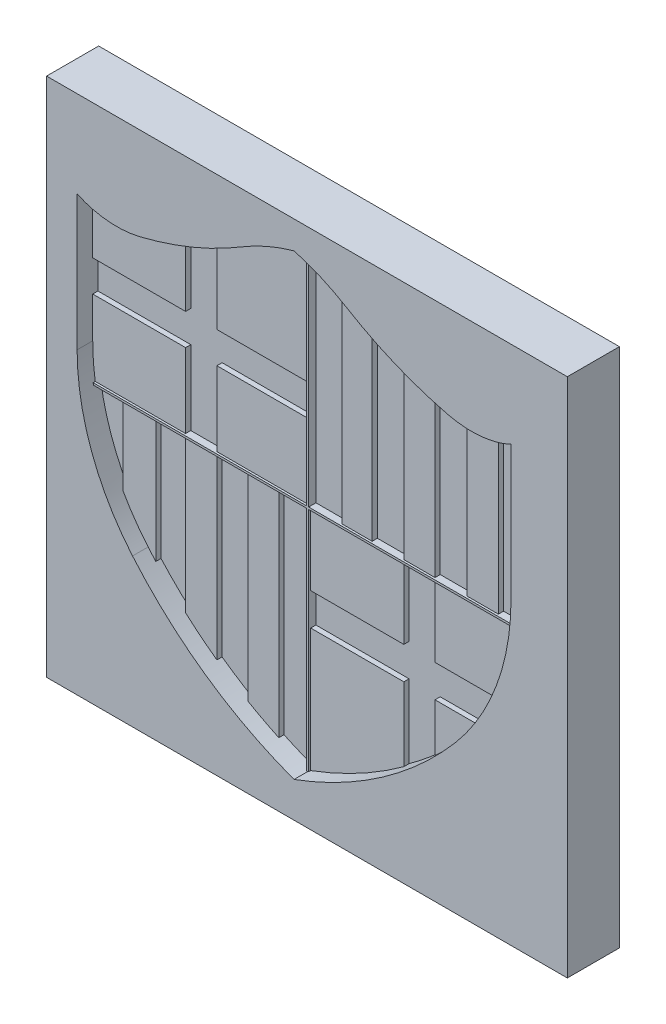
ISO-10303-21;
HEADER;
FILE_DESCRIPTION(('STEP AP214'),'2;1');
FILE_NAME('part.step','',(''),(''),'','','');
FILE_SCHEMA(('AUTOMOTIVE_DESIGN { 1 0 10303 214 1 1 1 1 }'));
ENDSEC;
DATA;
#1=APPLICATION_CONTEXT('core data for automotive mechanical design processes');
#2=APPLICATION_PROTOCOL_DEFINITION('international standard','automotive_design',2000,#1);
#3=PRODUCT_CONTEXT('',#1,'mechanical');
#4=PRODUCT('Part','Part','',(#3));
#5=PRODUCT_RELATED_PRODUCT_CATEGORY('part','',(#4));
#6=PRODUCT_DEFINITION_FORMATION('','',#4);
#7=PRODUCT_DEFINITION_CONTEXT('part definition',#1,'design');
#8=PRODUCT_DEFINITION('design','',#6,#7);
#9=PRODUCT_DEFINITION_SHAPE('','',#8);
#10=(LENGTH_UNIT() NAMED_UNIT(*) SI_UNIT(.MILLI.,.METRE.));
#11=(NAMED_UNIT(*) PLANE_ANGLE_UNIT() SI_UNIT($,.RADIAN.));
#12=(NAMED_UNIT(*) SI_UNIT($,.STERADIAN.) SOLID_ANGLE_UNIT());
#13=UNCERTAINTY_MEASURE_WITH_UNIT(LENGTH_MEASURE(1.E-05),#10,'distance_accuracy_value','');
#14=(GEOMETRIC_REPRESENTATION_CONTEXT(3) GLOBAL_UNCERTAINTY_ASSIGNED_CONTEXT((#13)) GLOBAL_UNIT_ASSIGNED_CONTEXT((#10,
#11,#12)) REPRESENTATION_CONTEXT('',''));
#15=CARTESIAN_POINT('',(0.,0.,0.));
#16=DIRECTION('',(0.,0.,1.));
#17=DIRECTION('',(1.,0.,0.));
#18=AXIS2_PLACEMENT_3D('',#15,#16,#17);
#19=CARTESIAN_POINT('',(-182.905067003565,200.675675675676,50.));
#20=DIRECTION('',(1.,0.,0.));
#21=DIRECTION('',(0.,1.,0.));
#22=AXIS2_PLACEMENT_3D('',#19,#20,#21);
#23=PLANE('',#22);
#24=DIRECTION('',(0.,-1.,0.));
#25=VECTOR('',#24,1.);
#26=CARTESIAN_POINT('',(-182.905067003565,200.675675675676,0.));
#27=LINE('',#26,#25);
#28=CARTESIAN_POINT('',(-182.905067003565,200.675675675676,0.));
#29=VERTEX_POINT('',#28);
#30=CARTESIAN_POINT('',(-182.905067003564,-299.324324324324,0.));
#31=VERTEX_POINT('',#30);
#32=EDGE_CURVE('E1125',#29,#31,#27,.T.);
#33=ORIENTED_EDGE('',*,*,#32,.T.);
#34=DIRECTION('',(0.,0.,-1.));
#35=VECTOR('',#34,1.);
#36=CARTESIAN_POINT('',(-182.905067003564,-299.324324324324,50.));
#37=LINE('',#36,#35);
#38=CARTESIAN_POINT('',(-182.905067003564,-299.324324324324,50.));
#39=VERTEX_POINT('',#38);
#40=EDGE_CURVE('E11',#39,#31,#37,.T.);
#41=ORIENTED_EDGE('',*,*,#40,.F.);
#42=DIRECTION('',(0.,-1.,0.));
#43=VECTOR('',#42,1.);
#44=CARTESIAN_POINT('',(-182.905067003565,200.675675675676,50.));
#45=LINE('',#44,#43);
#46=CARTESIAN_POINT('',(-182.905067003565,200.675675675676,50.));
#47=VERTEX_POINT('',#46);
#48=EDGE_CURVE('E1157',#47,#39,#45,.T.);
#49=ORIENTED_EDGE('',*,*,#48,.F.);
#50=DIRECTION('',(0.,0.,-1.));
#51=VECTOR('',#50,1.);
#52=CARTESIAN_POINT('',(-182.905067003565,200.675675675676,50.));
#53=LINE('',#52,#51);
#54=EDGE_CURVE('E1163',#47,#29,#53,.T.);
#55=ORIENTED_EDGE('',*,*,#54,.T.);
#56=EDGE_LOOP('',(#33,#41,#49,#55));
#57=FACE_BOUND('',#56,.T.);
#58=ADVANCED_FACE('F35',(#57),#23,.F.);
#59=CARTESIAN_POINT('',(-182.905067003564,-299.324324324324,50.));
#60=DIRECTION('',(0.,1.,0.));
#61=DIRECTION('',(0.,0.,1.));
#62=AXIS2_PLACEMENT_3D('',#59,#60,#61);
#63=PLANE('',#62);
#64=DIRECTION('',(1.,0.,0.));
#65=VECTOR('',#64,1.);
#66=CARTESIAN_POINT('',(-182.905067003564,-299.324324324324,0.));
#67=LINE('',#66,#65);
#68=CARTESIAN_POINT('',(317.094932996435,-299.324324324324,0.));
#69=VERTEX_POINT('',#68);
#70=EDGE_CURVE('E1166',#31,#69,#67,.T.);
#71=ORIENTED_EDGE('',*,*,#70,.T.);
#72=DIRECTION('',(0.,0.,-1.));
#73=VECTOR('',#72,1.);
#74=CARTESIAN_POINT('',(317.094932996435,-299.324324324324,50.));
#75=LINE('',#74,#73);
#76=CARTESIAN_POINT('',(317.094932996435,-299.324324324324,50.));
#77=VERTEX_POINT('',#76);
#78=EDGE_CURVE('E42',#77,#69,#75,.T.);
#79=ORIENTED_EDGE('',*,*,#78,.F.);
#80=DIRECTION('',(1.,0.,0.));
#81=VECTOR('',#80,1.);
#82=CARTESIAN_POINT('',(-182.905067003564,-299.324324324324,50.));
#83=LINE('',#82,#81);
#84=EDGE_CURVE('E86',#39,#77,#83,.T.);
#85=ORIENTED_EDGE('',*,*,#84,.F.);
#86=ORIENTED_EDGE('',*,*,#40,.T.);
#87=EDGE_LOOP('',(#71,#79,#85,#86));
#88=FACE_BOUND('',#87,.T.);
#89=ADVANCED_FACE('F1195',(#88),#63,.F.);
#90=CARTESIAN_POINT('',(317.094932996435,200.675675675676,50.));
#91=DIRECTION('',(-1.,0.,0.));
#92=DIRECTION('',(0.,0.,1.));
#93=AXIS2_PLACEMENT_3D('',#90,#91,#92);
#94=PLANE('',#93);
#95=DIRECTION('',(0.,1.,0.));
#96=VECTOR('',#95,1.);
#97=CARTESIAN_POINT('',(317.094932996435,200.675675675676,0.));
#98=LINE('',#97,#96);
#99=CARTESIAN_POINT('',(317.094932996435,200.675675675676,0.));
#100=VERTEX_POINT('',#99);
#101=EDGE_CURVE('E1168',#69,#100,#98,.T.);
#102=ORIENTED_EDGE('',*,*,#101,.T.);
#103=DIRECTION('',(0.,0.,-1.));
#104=VECTOR('',#103,1.);
#105=CARTESIAN_POINT('',(317.094932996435,200.675675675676,50.));
#106=LINE('',#105,#104);
#107=CARTESIAN_POINT('',(317.094932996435,200.675675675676,50.));
#108=VERTEX_POINT('',#107);
#109=EDGE_CURVE('E1172',#108,#100,#106,.T.);
#110=ORIENTED_EDGE('',*,*,#109,.F.);
#111=DIRECTION('',(0.,1.,0.));
#112=VECTOR('',#111,1.);
#113=CARTESIAN_POINT('',(317.094932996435,200.675675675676,50.));
#114=LINE('',#113,#112);
#115=EDGE_CURVE('E1160',#77,#108,#114,.T.);
#116=ORIENTED_EDGE('',*,*,#115,.F.);
#117=ORIENTED_EDGE('',*,*,#78,.T.);
#118=EDGE_LOOP('',(#102,#110,#116,#117));
#119=FACE_BOUND('',#118,.T.);
#120=ADVANCED_FACE('F1177',(#119),#94,.F.);
#121=CARTESIAN_POINT('',(-182.905067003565,200.675675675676,50.));
#122=DIRECTION('',(0.,-1.,0.));
#123=DIRECTION('',(0.,0.,-1.));
#124=AXIS2_PLACEMENT_3D('',#121,#122,#123);
#125=PLANE('',#124);
#126=DIRECTION('',(-1.,0.,0.));
#127=VECTOR('',#126,1.);
#128=CARTESIAN_POINT('',(-182.905067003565,200.675675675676,0.));
#129=LINE('',#128,#127);
#130=EDGE_CURVE('E79',#100,#29,#129,.T.);
#131=ORIENTED_EDGE('',*,*,#130,.T.);
#132=ORIENTED_EDGE('',*,*,#54,.F.);
#133=DIRECTION('',(-1.,0.,0.));
#134=VECTOR('',#133,1.);
#135=CARTESIAN_POINT('',(-182.905067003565,200.675675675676,50.));
#136=LINE('',#135,#134);
#137=EDGE_CURVE('E58',#108,#47,#136,.T.);
#138=ORIENTED_EDGE('',*,*,#137,.F.);
#139=ORIENTED_EDGE('',*,*,#109,.T.);
#140=EDGE_LOOP('',(#131,#132,#138,#139));
#141=FACE_BOUND('',#140,.T.);
#142=ADVANCED_FACE('F1185',(#141),#125,.F.);
#143=CARTESIAN_POINT('',(0.,0.,50.));
#144=DIRECTION('',(0.,0.,1.));
#145=DIRECTION('',(1.,0.,0.));
#146=AXIS2_PLACEMENT_3D('',#143,#144,#145);
#147=PLANE('',#146);
#148=DIRECTION('',(-0.914871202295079,-0.403745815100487,0.));
#149=VECTOR('',#148,1.);
#150=CARTESIAN_POINT('',(-176.105243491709,-76.2687050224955,50.));
#151=LINE('',#150,#149);
#152=CARTESIAN_POINT('',(262.99289624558,117.511617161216,50.));
#153=VERTEX_POINT('',#152);
#154=CARTESIAN_POINT('',(260.019902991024,116.199592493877,50.));
#155=VERTEX_POINT('',#154);
#156=EDGE_CURVE('E686',#153,#155,#151,.T.);
#157=ORIENTED_EDGE('',*,*,#156,.F.);
#158=DIRECTION('',(0.,-1.,0.));
#159=VECTOR('',#158,1.);
#160=CARTESIAN_POINT('',(262.99289624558,-275.11906388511,50.));
#161=LINE('',#160,#159);
#162=CARTESIAN_POINT('',(262.99289624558,-12.310182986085,50.));
#163=VERTEX_POINT('',#162);
#164=EDGE_CURVE('E662',#153,#163,#161,.T.);
#165=ORIENTED_EDGE('',*,*,#164,.T.);
#166=CARTESIAN_POINT('',(39.3315848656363,-12.310182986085,50.));
#167=DIRECTION('',(0.,0.,1.));
#168=DIRECTION('',(1.,0.,0.));
#169=AXIS2_PLACEMENT_3D('',#166,#167,#168);
#170=CIRCLE('',#169,223.661311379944);
#171=CARTESIAN_POINT('',(209.78063654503,-157.125593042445,50.));
#172=VERTEX_POINT('',#171);
#173=EDGE_CURVE('E1084',#163,#172,#170,.F.);
#174=ORIENTED_EDGE('',*,*,#173,.T.);
#175=CARTESIAN_POINT('',(-73.8448797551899,83.8458001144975,50.));
#176=DIRECTION('',(0.,0.,1.));
#177=DIRECTION('',(1.,0.,0.));
#178=AXIS2_PLACEMENT_3D('',#175,#176,#177);
#179=CIRCLE('',#178,372.170183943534);
#180=CARTESIAN_POINT('',(54.6961446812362,-265.421791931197,50.));
#181=VERTEX_POINT('',#180);
#182=EDGE_CURVE('E1088',#172,#181,#179,.F.);
#183=ORIENTED_EDGE('',*,*,#182,.T.);
#184=CARTESIAN_POINT('',(183.237169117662,83.8458001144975,50.));
#185=DIRECTION('',(0.,0.,1.));
#186=DIRECTION('',(1.,0.,0.));
#187=AXIS2_PLACEMENT_3D('',#184,#185,#186);
#188=CIRCLE('',#187,372.170183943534);
#189=CARTESIAN_POINT('',(-100.388347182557,-157.125593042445,50.));
#190=VERTEX_POINT('',#189);
#191=EDGE_CURVE('E986',#190,#181,#188,.T.);
#192=ORIENTED_EDGE('',*,*,#191,.F.);
#193=CARTESIAN_POINT('',(70.0607044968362,-12.310182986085,50.));
#194=DIRECTION('',(0.,0.,1.));
#195=DIRECTION('',(1.,0.,0.));
#196=AXIS2_PLACEMENT_3D('',#193,#194,#195);
#197=CIRCLE('',#196,223.661311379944);
#198=CARTESIAN_POINT('',(-153.600606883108,-12.310182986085,50.));
#199=VERTEX_POINT('',#198);
#200=EDGE_CURVE('E1025',#199,#190,#197,.T.);
#201=ORIENTED_EDGE('',*,*,#200,.F.);
#202=DIRECTION('',(0.,-1.,0.));
#203=VECTOR('',#202,1.);
#204=CARTESIAN_POINT('',(-153.600606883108,-275.11906388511,50.));
#205=LINE('',#204,#203);
#206=CARTESIAN_POINT('',(-153.600606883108,117.511617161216,50.));
#207=VERTEX_POINT('',#206);
#208=EDGE_CURVE('E921',#207,#199,#205,.T.);
#209=ORIENTED_EDGE('',*,*,#208,.F.);
#210=DIRECTION('',(0.914871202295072,-0.403745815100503,0.));
#211=VECTOR('',#210,1.);
#212=CARTESIAN_POINT('',(46.0418098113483,29.4065483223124,50.));
#213=LINE('',#212,#211);
#214=CARTESIAN_POINT('',(-150.627613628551,116.199592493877,50.));
#215=VERTEX_POINT('',#214);
#216=EDGE_CURVE('E837',#207,#215,#213,.T.);
#217=ORIENTED_EDGE('',*,*,#216,.T.);
#218=CARTESIAN_POINT('',(-119.846335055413,185.948687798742,50.));
#219=DIRECTION('',(0.,0.,1.));
#220=DIRECTION('',(1.,0.,0.));
#221=AXIS2_PLACEMENT_3D('',#218,#219,#220);
#222=CIRCLE('',#221,76.2392510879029);
#223=CARTESIAN_POINT('',(-138.088553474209,111.924064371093,50.));
#224=VERTEX_POINT('',#223);
#225=EDGE_CURVE('E853',#215,#224,#222,.T.);
#226=ORIENTED_EDGE('',*,*,#225,.T.);
#227=CARTESIAN_POINT('',(-115.565595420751,203.319389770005,50.));
#228=DIRECTION('',(0.,0.,1.));
#229=DIRECTION('',(1.,0.,0.));
#230=AXIS2_PLACEMENT_3D('',#227,#228,#229);
#231=CIRCLE('',#230,94.1296400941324);
#232=CARTESIAN_POINT('',(-93.0426373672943,111.924064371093,50.));
#233=VERTEX_POINT('',#232);
#234=EDGE_CURVE('E825',#224,#233,#231,.T.);
#235=ORIENTED_EDGE('',*,*,#234,.T.);
#236=CARTESIAN_POINT('',(-176.806122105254,451.825729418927,50.));
#237=DIRECTION('',(0.,0.,1.));
#238=DIRECTION('',(1.,0.,0.));
#239=AXIS2_PLACEMENT_3D('',#236,#237,#238);
#240=CIRCLE('',#239,350.070654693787);
#241=CARTESIAN_POINT('',(4.36398643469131,152.281316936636,50.));
#242=VERTEX_POINT('',#241);
#243=EDGE_CURVE('E916',#233,#242,#240,.T.);
#244=ORIENTED_EDGE('',*,*,#243,.T.);
#245=CARTESIAN_POINT('',(110.524762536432,-23.2435947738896,50.));
#246=DIRECTION('',(0.,0.,1.));
#247=DIRECTION('',(1.,0.,0.));
#248=AXIS2_PLACEMENT_3D('',#245,#246,#247);
#249=CIRCLE('',#248,205.131921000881);
#250=CARTESIAN_POINT('',(54.6961446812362,174.145033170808,50.));
#251=VERTEX_POINT('',#250);
#252=EDGE_CURVE('E1022',#242,#251,#249,.F.);
#253=ORIENTED_EDGE('',*,*,#252,.T.);
#254=CARTESIAN_POINT('',(-1.13247317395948,-23.2435947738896,50.));
#255=DIRECTION('',(0.,0.,1.));
#256=DIRECTION('',(1.,0.,0.));
#257=AXIS2_PLACEMENT_3D('',#254,#255,#256);
#258=CIRCLE('',#257,205.131921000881);
#259=CARTESIAN_POINT('',(105.028302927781,152.281316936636,50.));
#260=VERTEX_POINT('',#259);
#261=EDGE_CURVE('E952',#260,#251,#258,.T.);
#262=ORIENTED_EDGE('',*,*,#261,.F.);
#263=CARTESIAN_POINT('',(286.198411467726,451.825729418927,50.));
#264=DIRECTION('',(0.,0.,1.));
#265=DIRECTION('',(1.,0.,0.));
#266=AXIS2_PLACEMENT_3D('',#263,#264,#265);
#267=CIRCLE('',#266,350.070654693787);
#268=CARTESIAN_POINT('',(202.434926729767,111.924064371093,50.));
#269=VERTEX_POINT('',#268);
#270=EDGE_CURVE('E623',#269,#260,#267,.F.);
#271=ORIENTED_EDGE('',*,*,#270,.F.);
#272=CARTESIAN_POINT('',(224.957884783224,203.319389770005,50.));
#273=DIRECTION('',(0.,0.,1.));
#274=DIRECTION('',(1.,0.,0.));
#275=AXIS2_PLACEMENT_3D('',#272,#273,#274);
#276=CIRCLE('',#275,94.1296400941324);
#277=CARTESIAN_POINT('',(247.480842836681,111.924064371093,50.));
#278=VERTEX_POINT('',#277);
#279=EDGE_CURVE('E667',#278,#269,#276,.F.);
#280=ORIENTED_EDGE('',*,*,#279,.F.);
#281=CARTESIAN_POINT('',(229.238624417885,185.948687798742,50.));
#282=DIRECTION('',(0.,0.,1.));
#283=DIRECTION('',(1.,0.,0.));
#284=AXIS2_PLACEMENT_3D('',#281,#282,#283);
#285=CIRCLE('',#284,76.2392510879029);
#286=EDGE_CURVE('E689',#155,#278,#285,.F.);
#287=ORIENTED_EDGE('',*,*,#286,.F.);
#288=EDGE_LOOP('',(#157,#165,#174,#183,#192,#201,#209,#217,#226,#235,#244,#253,#262,#271,#280,#287));
#289=FACE_BOUND('',#288,.T.);
#290=ORIENTED_EDGE('',*,*,#48,.T.);
#291=ORIENTED_EDGE('',*,*,#84,.T.);
#292=ORIENTED_EDGE('',*,*,#115,.T.);
#293=ORIENTED_EDGE('',*,*,#137,.T.);
#294=EDGE_LOOP('',(#290,#291,#292,#293));
#295=FACE_BOUND('',#294,.T.);
#296=ADVANCED_FACE('F1187',(#289,#295),#147,.T.);
#297=CARTESIAN_POINT('',(0.,0.,0.));
#298=DIRECTION('',(0.,0.,1.));
#299=DIRECTION('',(1.,0.,0.));
#300=AXIS2_PLACEMENT_3D('',#297,#298,#299);
#301=PLANE('',#300);
#302=ORIENTED_EDGE('',*,*,#32,.F.);
#303=ORIENTED_EDGE('',*,*,#130,.F.);
#304=ORIENTED_EDGE('',*,*,#101,.F.);
#305=ORIENTED_EDGE('',*,*,#70,.F.);
#306=EDGE_LOOP('',(#302,#303,#304,#305));
#307=FACE_BOUND('',#306,.T.);
#308=ADVANCED_FACE('F1181',(#307),#301,.F.);
#309=CARTESIAN_POINT('',(55.6961446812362,-275.11906388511,30.));
#310=DIRECTION('',(-1.,0.,0.));
#311=DIRECTION('',(0.,0.,1.));
#312=AXIS2_PLACEMENT_3D('',#309,#310,#311);
#313=PLANE('',#312);
#314=DIRECTION('',(0.,0.,1.));
#315=VECTOR('',#314,1.);
#316=CARTESIAN_POINT('',(55.6961446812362,-265.052134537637,35.));
#317=LINE('',#316,#315);
#318=CARTESIAN_POINT('',(55.6961446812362,-265.052134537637,35.));
#319=VERTEX_POINT('',#318);
#320=CARTESIAN_POINT('',(55.6961446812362,-265.052134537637,37.));
#321=VERTEX_POINT('',#320);
#322=EDGE_CURVE('E1054',#319,#321,#317,.T.);
#323=ORIENTED_EDGE('',*,*,#322,.F.);
#324=DIRECTION('',(0.,-1.,0.));
#325=VECTOR('',#324,1.);
#326=CARTESIAN_POINT('',(55.6961446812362,-275.11906388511,35.));
#327=LINE('',#326,#325);
#328=CARTESIAN_POINT('',(55.6961446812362,-146.513514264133,35.));
#329=VERTEX_POINT('',#328);
#330=EDGE_CURVE('E1051',#329,#319,#327,.T.);
#331=ORIENTED_EDGE('',*,*,#330,.F.);
#332=DIRECTION('',(0.,0.,1.));
#333=VECTOR('',#332,1.);
#334=CARTESIAN_POINT('',(55.6961446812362,-146.513514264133,30.));
#335=LINE('',#334,#333);
#336=CARTESIAN_POINT('',(55.6961446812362,-146.513514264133,30.));
#337=VERTEX_POINT('',#336);
#338=EDGE_CURVE('E1137',#337,#329,#335,.T.);
#339=ORIENTED_EDGE('',*,*,#338,.F.);
#340=DIRECTION('',(0.,-1.,0.));
#341=VECTOR('',#340,1.);
#342=CARTESIAN_POINT('',(55.6961446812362,-275.11906388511,30.));
#343=LINE('',#342,#341);
#344=CARTESIAN_POINT('',(55.6961446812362,-115.421714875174,30.));
#345=VERTEX_POINT('',#344);
#346=EDGE_CURVE('E1101',#345,#337,#343,.T.);
#347=ORIENTED_EDGE('',*,*,#346,.F.);
#348=DIRECTION('',(0.,0.,1.));
#349=VECTOR('',#348,1.);
#350=CARTESIAN_POINT('',(55.6961446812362,-115.421714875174,30.));
#351=LINE('',#350,#349);
#352=CARTESIAN_POINT('',(55.6961446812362,-115.421714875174,35.));
#353=VERTEX_POINT('',#352);
#354=EDGE_CURVE('E1140',#345,#353,#351,.T.);
#355=ORIENTED_EDGE('',*,*,#354,.T.);
#356=DIRECTION('',(0.,-1.,0.));
#357=VECTOR('',#356,1.);
#358=CARTESIAN_POINT('',(55.6961446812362,-275.11906388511,35.));
#359=LINE('',#358,#357);
#360=CARTESIAN_POINT('',(55.6961446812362,-46.8816804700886,35.));
#361=VERTEX_POINT('',#360);
#362=EDGE_CURVE('E1060',#361,#353,#359,.T.);
#363=ORIENTED_EDGE('',*,*,#362,.F.);
#364=DIRECTION('',(0.,0.,1.));
#365=VECTOR('',#364,1.);
#366=CARTESIAN_POINT('',(55.6961446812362,-46.8816804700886,35.));
#367=LINE('',#366,#365);
#368=CARTESIAN_POINT('',(55.6961446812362,-46.8816804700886,37.));
#369=VERTEX_POINT('',#368);
#370=EDGE_CURVE('E1068',#361,#369,#367,.T.);
#371=ORIENTED_EDGE('',*,*,#370,.T.);
#372=DIRECTION('',(0.,-1.,0.));
#373=VECTOR('',#372,1.);
#374=CARTESIAN_POINT('',(55.6961446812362,-275.11906388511,37.));
#375=LINE('',#374,#373);
#376=EDGE_CURVE('E1016',#369,#321,#375,.T.);
#377=ORIENTED_EDGE('',*,*,#376,.T.);
#378=EDGE_LOOP('',(#323,#331,#339,#347,#355,#363,#371,#377));
#379=FACE_BOUND('',#378,.T.);
#380=ADVANCED_FACE('F1222',(#379),#313,.F.);
#381=CARTESIAN_POINT('',(-88.3497211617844,-46.8816804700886,30.));
#382=DIRECTION('',(0.,1.,0.));
#383=DIRECTION('',(0.,0.,1.));
#384=AXIS2_PLACEMENT_3D('',#381,#382,#383);
#385=PLANE('',#384);
#386=ORIENTED_EDGE('',*,*,#370,.F.);
#387=DIRECTION('',(-1.,0.,0.));
#388=VECTOR('',#387,1.);
#389=CARTESIAN_POINT('',(-88.3497211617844,-46.8816804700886,35.));
#390=LINE('',#389,#388);
#391=CARTESIAN_POINT('',(145.104615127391,-46.8816804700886,35.));
#392=VERTEX_POINT('',#391);
#393=EDGE_CURVE('E1057',#392,#361,#390,.T.);
#394=ORIENTED_EDGE('',*,*,#393,.F.);
#395=DIRECTION('',(0.,0.,1.));
#396=VECTOR('',#395,1.);
#397=CARTESIAN_POINT('',(145.104615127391,-46.8816804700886,30.));
#398=LINE('',#397,#396);
#399=CARTESIAN_POINT('',(145.104615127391,-46.8816804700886,30.));
#400=VERTEX_POINT('',#399);
#401=EDGE_CURVE('E1146',#400,#392,#398,.T.);
#402=ORIENTED_EDGE('',*,*,#401,.F.);
#403=DIRECTION('',(-1.,0.,0.));
#404=VECTOR('',#403,1.);
#405=CARTESIAN_POINT('',(-88.3497211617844,-46.8816804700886,30.));
#406=LINE('',#405,#404);
#407=CARTESIAN_POINT('',(175.063823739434,-46.8816804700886,30.));
#408=VERTEX_POINT('',#407);
#409=EDGE_CURVE('E1093',#408,#400,#406,.T.);
#410=ORIENTED_EDGE('',*,*,#409,.F.);
#411=DIRECTION('',(0.,0.,1.));
#412=VECTOR('',#411,1.);
#413=CARTESIAN_POINT('',(175.063823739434,-46.8816804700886,30.));
#414=LINE('',#413,#412);
#415=CARTESIAN_POINT('',(175.063823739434,-46.8816804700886,35.));
#416=VERTEX_POINT('',#415);
#417=EDGE_CURVE('E1149',#408,#416,#414,.T.);
#418=ORIENTED_EDGE('',*,*,#417,.T.);
#419=DIRECTION('',(-1.,0.,0.));
#420=VECTOR('',#419,1.);
#421=CARTESIAN_POINT('',(-88.3497211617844,-46.8816804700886,35.));
#422=LINE('',#421,#420);
#423=CARTESIAN_POINT('',(260.304872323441,-46.8816804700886,35.));
#424=VERTEX_POINT('',#423);
#425=EDGE_CURVE('E1073',#424,#416,#422,.T.);
#426=ORIENTED_EDGE('',*,*,#425,.F.);
#427=DIRECTION('',(0.,0.,1.));
#428=VECTOR('',#427,1.);
#429=CARTESIAN_POINT('',(260.304872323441,-46.8816804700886,35.));
#430=LINE('',#429,#428);
#431=CARTESIAN_POINT('',(260.304872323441,-46.8816804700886,37.));
#432=VERTEX_POINT('',#431);
#433=EDGE_CURVE('E1081',#424,#432,#430,.T.);
#434=ORIENTED_EDGE('',*,*,#433,.T.);
#435=DIRECTION('',(-1.,0.,0.));
#436=VECTOR('',#435,1.);
#437=CARTESIAN_POINT('',(-88.3497211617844,-46.8816804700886,37.));
#438=LINE('',#437,#436);
#439=EDGE_CURVE('E1018',#432,#369,#438,.T.);
#440=ORIENTED_EDGE('',*,*,#439,.T.);
#441=EDGE_LOOP('',(#386,#394,#402,#410,#418,#426,#434,#440));
#442=FACE_BOUND('',#441,.T.);
#443=ADVANCED_FACE('F1236',(#442),#385,.F.);
#444=CARTESIAN_POINT('',(-88.3497211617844,-146.513514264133,30.));
#445=DIRECTION('',(0.,-1.,0.));
#446=DIRECTION('',(0.,0.,-1.));
#447=AXIS2_PLACEMENT_3D('',#444,#445,#446);
#448=PLANE('',#447);
#449=DIRECTION('',(0.,0.,1.));
#450=VECTOR('',#449,1.);
#451=CARTESIAN_POINT('',(218.255725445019,-146.513514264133,30.));
#452=LINE('',#451,#450);
#453=CARTESIAN_POINT('',(218.255725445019,-146.513514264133,30.));
#454=VERTEX_POINT('',#453);
#455=CARTESIAN_POINT('',(218.255725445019,-146.513514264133,35.));
#456=VERTEX_POINT('',#455);
#457=EDGE_CURVE('E1122',#454,#456,#452,.T.);
#458=ORIENTED_EDGE('',*,*,#457,.F.);
#459=DIRECTION('',(1.,0.,0.));
#460=VECTOR('',#459,1.);
#461=CARTESIAN_POINT('',(-88.3497211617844,-146.513514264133,30.));
#462=LINE('',#461,#460);
#463=CARTESIAN_POINT('',(175.063823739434,-146.513514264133,30.));
#464=VERTEX_POINT('',#463);
#465=EDGE_CURVE('E1114',#464,#454,#462,.T.);
#466=ORIENTED_EDGE('',*,*,#465,.F.);
#467=DIRECTION('',(0.,0.,1.));
#468=VECTOR('',#467,1.);
#469=CARTESIAN_POINT('',(175.063823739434,-146.513514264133,30.));
#470=LINE('',#469,#468);
#471=CARTESIAN_POINT('',(175.063823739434,-146.513514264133,35.));
#472=VERTEX_POINT('',#471);
#473=EDGE_CURVE('E1126',#464,#472,#470,.T.);
#474=ORIENTED_EDGE('',*,*,#473,.T.);
#475=DIRECTION('',(1.,0.,0.));
#476=VECTOR('',#475,1.);
#477=CARTESIAN_POINT('',(-88.3497211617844,-146.513514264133,35.));
#478=LINE('',#477,#476);
#479=EDGE_CURVE('E1035',#472,#456,#478,.T.);
#480=ORIENTED_EDGE('',*,*,#479,.T.);
#481=EDGE_LOOP('',(#458,#466,#474,#480));
#482=FACE_BOUND('',#481,.T.);
#483=ADVANCED_FACE('F1248',(#482),#448,.F.);
#484=CARTESIAN_POINT('',(175.063823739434,-275.11906388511,30.));
#485=DIRECTION('',(1.,0.,0.));
#486=DIRECTION('',(0.,0.,-1.));
#487=AXIS2_PLACEMENT_3D('',#484,#485,#486);
#488=PLANE('',#487);
#489=ORIENTED_EDGE('',*,*,#473,.F.);
#490=DIRECTION('',(0.,1.,0.));
#491=VECTOR('',#490,1.);
#492=CARTESIAN_POINT('',(175.063823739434,-275.11906388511,30.));
#493=LINE('',#492,#491);
#494=CARTESIAN_POINT('',(175.063823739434,-192.840128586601,30.));
#495=VERTEX_POINT('',#494);
#496=EDGE_CURVE('E1111',#495,#464,#493,.T.);
#497=ORIENTED_EDGE('',*,*,#496,.F.);
#498=DIRECTION('',(0.,0.,1.));
#499=VECTOR('',#498,1.);
#500=CARTESIAN_POINT('',(175.063823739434,-192.840128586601,30.));
#501=LINE('',#500,#499);
#502=CARTESIAN_POINT('',(175.063823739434,-192.840128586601,35.));
#503=VERTEX_POINT('',#502);
#504=EDGE_CURVE('E1129',#495,#503,#501,.T.);
#505=ORIENTED_EDGE('',*,*,#504,.T.);
#506=DIRECTION('',(0.,1.,0.));
#507=VECTOR('',#506,1.);
#508=CARTESIAN_POINT('',(175.063823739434,-275.11906388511,35.));
#509=LINE('',#508,#507);
#510=EDGE_CURVE('E1037',#503,#472,#509,.T.);
#511=ORIENTED_EDGE('',*,*,#510,.T.);
#512=EDGE_LOOP('',(#489,#497,#505,#511));
#513=FACE_BOUND('',#512,.T.);
#514=ADVANCED_FACE('F1259',(#513),#488,.F.);
#515=CARTESIAN_POINT('',(145.10461512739,-275.119063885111,30.));
#516=DIRECTION('',(1.,0.,0.));
#517=DIRECTION('',(0.,1.,0.));
#518=AXIS2_PLACEMENT_3D('',#515,#516,#517);
#519=PLANE('',#518);
#520=DIRECTION('',(0.,1.,0.));
#521=VECTOR('',#520,1.);
#522=CARTESIAN_POINT('',(145.10461512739,-275.119063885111,35.));
#523=LINE('',#522,#521);
#524=CARTESIAN_POINT('',(145.10461512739,-217.105632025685,35.));
#525=VERTEX_POINT('',#524);
#526=CARTESIAN_POINT('',(145.104615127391,-146.513514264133,35.));
#527=VERTEX_POINT('',#526);
#528=EDGE_CURVE('E1046',#525,#527,#523,.T.);
#529=ORIENTED_EDGE('',*,*,#528,.F.);
#530=DIRECTION('',(0.,0.,1.));
#531=VECTOR('',#530,1.);
#532=CARTESIAN_POINT('',(145.10461512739,-217.105632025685,30.));
#533=LINE('',#532,#531);
#534=CARTESIAN_POINT('',(145.10461512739,-217.105632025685,30.));
#535=VERTEX_POINT('',#534);
#536=EDGE_CURVE('E1132',#535,#525,#533,.T.);
#537=ORIENTED_EDGE('',*,*,#536,.F.);
#538=DIRECTION('',(0.,1.,0.));
#539=VECTOR('',#538,1.);
#540=CARTESIAN_POINT('',(145.10461512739,-275.119063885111,30.));
#541=LINE('',#540,#539);
#542=CARTESIAN_POINT('',(145.104615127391,-146.513514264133,30.));
#543=VERTEX_POINT('',#542);
#544=EDGE_CURVE('E1107',#535,#543,#541,.T.);
#545=ORIENTED_EDGE('',*,*,#544,.T.);
#546=DIRECTION('',(0.,0.,1.));
#547=VECTOR('',#546,1.);
#548=CARTESIAN_POINT('',(145.104615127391,-146.513514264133,30.));
#549=LINE('',#548,#547);
#550=EDGE_CURVE('E1134',#543,#527,#549,.T.);
#551=ORIENTED_EDGE('',*,*,#550,.T.);
#552=EDGE_LOOP('',(#529,#537,#545,#551));
#553=FACE_BOUND('',#552,.T.);
#554=ADVANCED_FACE('F1269',(#553),#519,.T.);
#555=CARTESIAN_POINT('',(-88.3497211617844,-146.513514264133,30.));
#556=DIRECTION('',(0.,-1.,0.));
#557=DIRECTION('',(0.,0.,-1.));
#558=AXIS2_PLACEMENT_3D('',#555,#556,#557);
#559=PLANE('',#558);
#560=ORIENTED_EDGE('',*,*,#550,.F.);
#561=DIRECTION('',(1.,0.,0.));
#562=VECTOR('',#561,1.);
#563=CARTESIAN_POINT('',(-88.3497211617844,-146.513514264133,30.));
#564=LINE('',#563,#562);
#565=EDGE_CURVE('E1104',#337,#543,#564,.T.);
#566=ORIENTED_EDGE('',*,*,#565,.F.);
#567=ORIENTED_EDGE('',*,*,#338,.T.);
#568=DIRECTION('',(1.,0.,0.));
#569=VECTOR('',#568,1.);
#570=CARTESIAN_POINT('',(-88.3497211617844,-146.513514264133,35.));
#571=LINE('',#570,#569);
#572=EDGE_CURVE('E1048',#329,#527,#571,.T.);
#573=ORIENTED_EDGE('',*,*,#572,.T.);
#574=EDGE_LOOP('',(#560,#566,#567,#573));
#575=FACE_BOUND('',#574,.T.);
#576=ADVANCED_FACE('F1279',(#575),#559,.F.);
#577=CARTESIAN_POINT('',(-88.3497211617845,-115.421714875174,30.));
#578=DIRECTION('',(0.,1.,0.));
#579=DIRECTION('',(-1.,0.,0.));
#580=AXIS2_PLACEMENT_3D('',#577,#578,#579);
#581=PLANE('',#580);
#582=ORIENTED_EDGE('',*,*,#354,.F.);
#583=DIRECTION('',(-1.,0.,0.));
#584=VECTOR('',#583,1.);
#585=CARTESIAN_POINT('',(-88.3497211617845,-115.421714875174,30.));
#586=LINE('',#585,#584);
#587=CARTESIAN_POINT('',(145.104615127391,-115.421714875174,30.));
#588=VERTEX_POINT('',#587);
#589=EDGE_CURVE('E1098',#588,#345,#586,.T.);
#590=ORIENTED_EDGE('',*,*,#589,.F.);
#591=DIRECTION('',(0.,0.,1.));
#592=VECTOR('',#591,1.);
#593=CARTESIAN_POINT('',(145.104615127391,-115.421714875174,30.));
#594=LINE('',#593,#592);
#595=CARTESIAN_POINT('',(145.104615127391,-115.421714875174,35.));
#596=VERTEX_POINT('',#595);
#597=EDGE_CURVE('E1143',#588,#596,#594,.T.);
#598=ORIENTED_EDGE('',*,*,#597,.T.);
#599=DIRECTION('',(-1.,0.,0.));
#600=VECTOR('',#599,1.);
#601=CARTESIAN_POINT('',(-88.3497211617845,-115.421714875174,35.));
#602=LINE('',#601,#600);
#603=EDGE_CURVE('E1063',#596,#353,#602,.T.);
#604=ORIENTED_EDGE('',*,*,#603,.T.);
#605=EDGE_LOOP('',(#582,#590,#598,#604));
#606=FACE_BOUND('',#605,.T.);
#607=ADVANCED_FACE('F1289',(#606),#581,.F.);
#608=CARTESIAN_POINT('',(145.104615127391,-275.11906388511,30.));
#609=DIRECTION('',(1.,0.,0.));
#610=DIRECTION('',(0.,1.,0.));
#611=AXIS2_PLACEMENT_3D('',#608,#609,#610);
#612=PLANE('',#611);
#613=DIRECTION('',(0.,1.,0.));
#614=VECTOR('',#613,1.);
#615=CARTESIAN_POINT('',(145.104615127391,-275.11906388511,35.));
#616=LINE('',#615,#614);
#617=EDGE_CURVE('E1065',#596,#392,#616,.T.);
#618=ORIENTED_EDGE('',*,*,#617,.F.);
#619=ORIENTED_EDGE('',*,*,#597,.F.);
#620=DIRECTION('',(0.,1.,0.));
#621=VECTOR('',#620,1.);
#622=CARTESIAN_POINT('',(145.104615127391,-275.11906388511,30.));
#623=LINE('',#622,#621);
#624=EDGE_CURVE('E1096',#588,#400,#623,.T.);
#625=ORIENTED_EDGE('',*,*,#624,.T.);
#626=ORIENTED_EDGE('',*,*,#401,.T.);
#627=EDGE_LOOP('',(#618,#619,#625,#626));
#628=FACE_BOUND('',#627,.T.);
#629=ADVANCED_FACE('F1299',(#628),#612,.T.);
#630=CARTESIAN_POINT('',(175.063823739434,-275.11906388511,30.));
#631=DIRECTION('',(1.,0.,0.));
#632=DIRECTION('',(0.,0.,-1.));
#633=AXIS2_PLACEMENT_3D('',#630,#631,#632);
#634=PLANE('',#633);
#635=ORIENTED_EDGE('',*,*,#417,.F.);
#636=DIRECTION('',(0.,1.,0.));
#637=VECTOR('',#636,1.);
#638=CARTESIAN_POINT('',(175.063823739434,-275.11906388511,30.));
#639=LINE('',#638,#637);
#640=CARTESIAN_POINT('',(175.063823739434,-115.421714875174,30.));
#641=VERTEX_POINT('',#640);
#642=EDGE_CURVE('E1090',#641,#408,#639,.T.);
#643=ORIENTED_EDGE('',*,*,#642,.F.);
#644=DIRECTION('',(0.,0.,1.));
#645=VECTOR('',#644,1.);
#646=CARTESIAN_POINT('',(175.063823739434,-115.421714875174,30.));
#647=LINE('',#646,#645);
#648=CARTESIAN_POINT('',(175.063823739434,-115.421714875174,35.));
#649=VERTEX_POINT('',#648);
#650=EDGE_CURVE('E1152',#641,#649,#647,.T.);
#651=ORIENTED_EDGE('',*,*,#650,.T.);
#652=DIRECTION('',(0.,1.,0.));
#653=VECTOR('',#652,1.);
#654=CARTESIAN_POINT('',(175.063823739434,-275.11906388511,35.));
#655=LINE('',#654,#653);
#656=EDGE_CURVE('E1076',#649,#416,#655,.T.);
#657=ORIENTED_EDGE('',*,*,#656,.T.);
#658=EDGE_LOOP('',(#635,#643,#651,#657));
#659=FACE_BOUND('',#658,.T.);
#660=ADVANCED_FACE('F1309',(#659),#634,.F.);
#661=CARTESIAN_POINT('',(-88.3497211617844,-115.421714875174,30.));
#662=DIRECTION('',(0.,-1.,0.));
#663=DIRECTION('',(0.,0.,-1.));
#664=AXIS2_PLACEMENT_3D('',#661,#662,#663);
#665=PLANE('',#664);
#666=DIRECTION('',(1.,0.,0.));
#667=VECTOR('',#666,1.);
#668=CARTESIAN_POINT('',(-88.3497211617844,-115.421714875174,35.));
#669=LINE('',#668,#667);
#670=CARTESIAN_POINT('',(237.806757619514,-115.421714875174,35.));
#671=VERTEX_POINT('',#670);
#672=EDGE_CURVE('E1078',#649,#671,#669,.T.);
#673=ORIENTED_EDGE('',*,*,#672,.F.);
#674=ORIENTED_EDGE('',*,*,#650,.F.);
#675=DIRECTION('',(1.,0.,0.));
#676=VECTOR('',#675,1.);
#677=CARTESIAN_POINT('',(-88.3497211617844,-115.421714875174,30.));
#678=LINE('',#677,#676);
#679=CARTESIAN_POINT('',(237.806757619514,-115.421714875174,30.));
#680=VERTEX_POINT('',#679);
#681=EDGE_CURVE('E1087',#641,#680,#678,.T.);
#682=ORIENTED_EDGE('',*,*,#681,.T.);
#683=DIRECTION('',(0.,0.,1.));
#684=VECTOR('',#683,1.);
#685=CARTESIAN_POINT('',(237.806757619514,-115.421714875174,30.));
#686=LINE('',#685,#684);
#687=EDGE_CURVE('E1117',#680,#671,#686,.T.);
#688=ORIENTED_EDGE('',*,*,#687,.T.);
#689=EDGE_LOOP('',(#673,#674,#682,#688));
#690=FACE_BOUND('',#689,.T.);
#691=ADVANCED_FACE('F1319',(#690),#665,.T.);
#692=CARTESIAN_POINT('',(39.3315848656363,-12.310182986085,30.));
#693=DIRECTION('',(0.,0.,1.));
#694=DIRECTION('',(1.,0.,0.));
#695=AXIS2_PLACEMENT_3D('',#692,#693,#694);
#696=CYLINDRICAL_SURFACE('',#695,223.661311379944);
#697=ORIENTED_EDGE('',*,*,#173,.F.);
#698=DIRECTION('',(0.,0.,1.));
#699=VECTOR('',#698,1.);
#700=CARTESIAN_POINT('',(262.99289624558,-12.310182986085,30.));
#701=LINE('',#700,#699);
#702=CARTESIAN_POINT('',(262.99289624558,-12.310182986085,30.));
#703=VERTEX_POINT('',#702);
#704=EDGE_CURVE('E683',#703,#163,#701,.T.);
#705=ORIENTED_EDGE('',*,*,#704,.F.);
#706=CARTESIAN_POINT('',(39.3315848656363,-12.310182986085,30.));
#707=DIRECTION('',(0.,0.,1.));
#708=DIRECTION('',(1.,0.,0.));
#709=AXIS2_PLACEMENT_3D('',#706,#707,#708);
#710=CIRCLE('',#709,223.661311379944);
#711=CARTESIAN_POINT('',(260.608514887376,-44.8816804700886,30.));
#712=VERTEX_POINT('',#711);
#713=EDGE_CURVE('E663',#703,#712,#710,.F.);
#714=ORIENTED_EDGE('',*,*,#713,.T.);
#715=DIRECTION('',(0.,0.,1.));
#716=VECTOR('',#715,1.);
#717=CARTESIAN_POINT('',(260.608514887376,-44.8816804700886,30.));
#718=LINE('',#717,#716);
#719=CARTESIAN_POINT('',(260.608514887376,-44.8816804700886,37.));
#720=VERTEX_POINT('',#719);
#721=EDGE_CURVE('E693',#712,#720,#718,.T.);
#722=ORIENTED_EDGE('',*,*,#721,.T.);
#723=CARTESIAN_POINT('',(39.3315848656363,-12.310182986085,37.));
#724=DIRECTION('',(0.,0.,1.));
#725=DIRECTION('',(1.,0.,0.));
#726=AXIS2_PLACEMENT_3D('',#723,#724,#725);
#727=CIRCLE('',#726,223.661311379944);
#728=EDGE_CURVE('E983',#720,#432,#727,.F.);
#729=ORIENTED_EDGE('',*,*,#728,.T.);
#730=ORIENTED_EDGE('',*,*,#433,.F.);
#731=CARTESIAN_POINT('',(39.3315848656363,-12.310182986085,35.));
#732=DIRECTION('',(0.,0.,1.));
#733=DIRECTION('',(1.,0.,0.));
#734=AXIS2_PLACEMENT_3D('',#731,#732,#733);
#735=CIRCLE('',#734,223.661311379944);
#736=EDGE_CURVE('E1071',#424,#671,#735,.F.);
#737=ORIENTED_EDGE('',*,*,#736,.T.);
#738=ORIENTED_EDGE('',*,*,#687,.F.);
#739=CARTESIAN_POINT('',(39.3315848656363,-12.310182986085,30.));
#740=DIRECTION('',(0.,0.,1.));
#741=DIRECTION('',(1.,0.,0.));
#742=AXIS2_PLACEMENT_3D('',#739,#740,#741);
#743=CIRCLE('',#742,223.661311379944);
#744=EDGE_CURVE('E1085',#680,#454,#743,.F.);
#745=ORIENTED_EDGE('',*,*,#744,.T.);
#746=ORIENTED_EDGE('',*,*,#457,.T.);
#747=CARTESIAN_POINT('',(39.3315848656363,-12.310182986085,35.));
#748=DIRECTION('',(0.,0.,1.));
#749=DIRECTION('',(1.,0.,0.));
#750=AXIS2_PLACEMENT_3D('',#747,#748,#749);
#751=CIRCLE('',#750,223.661311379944);
#752=CARTESIAN_POINT('',(209.78063654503,-157.125593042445,35.));
#753=VERTEX_POINT('',#752);
#754=EDGE_CURVE('E1031',#456,#753,#751,.F.);
#755=ORIENTED_EDGE('',*,*,#754,.T.);
#756=DIRECTION('',(0.,0.,1.));
#757=VECTOR('',#756,1.);
#758=CARTESIAN_POINT('',(209.78063654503,-157.125593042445,35.));
#759=LINE('',#758,#757);
#760=EDGE_CURVE('E1041',#753,#172,#759,.T.);
#761=ORIENTED_EDGE('',*,*,#760,.T.);
#762=EDGE_LOOP('',(#697,#705,#714,#722,#729,#730,#737,#738,#745,#746,#755,#761));
#763=FACE_BOUND('',#762,.T.);
#764=ADVANCED_FACE('F1329',(#763),#696,.F.);
#765=CARTESIAN_POINT('',(-73.8448797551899,83.8458001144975,30.));
#766=DIRECTION('',(0.,0.,1.));
#767=DIRECTION('',(1.,0.,0.));
#768=AXIS2_PLACEMENT_3D('',#765,#766,#767);
#769=CYLINDRICAL_SURFACE('',#768,372.170183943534);
#770=ORIENTED_EDGE('',*,*,#182,.F.);
#771=ORIENTED_EDGE('',*,*,#760,.F.);
#772=CARTESIAN_POINT('',(-73.8448797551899,83.8458001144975,35.));
#773=DIRECTION('',(0.,0.,1.));
#774=DIRECTION('',(1.,0.,0.));
#775=AXIS2_PLACEMENT_3D('',#772,#773,#774);
#776=CIRCLE('',#775,372.170183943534);
#777=EDGE_CURVE('E1039',#753,#503,#776,.F.);
#778=ORIENTED_EDGE('',*,*,#777,.T.);
#779=ORIENTED_EDGE('',*,*,#504,.F.);
#780=CARTESIAN_POINT('',(-73.8448797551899,83.8458001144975,30.));
#781=DIRECTION('',(0.,0.,1.));
#782=DIRECTION('',(1.,0.,0.));
#783=AXIS2_PLACEMENT_3D('',#780,#781,#782);
#784=CIRCLE('',#783,372.170183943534);
#785=EDGE_CURVE('E1109',#495,#535,#784,.F.);
#786=ORIENTED_EDGE('',*,*,#785,.T.);
#787=ORIENTED_EDGE('',*,*,#536,.T.);
#788=CARTESIAN_POINT('',(-73.8448797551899,83.8458001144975,35.));
#789=DIRECTION('',(0.,0.,1.));
#790=DIRECTION('',(1.,0.,0.));
#791=AXIS2_PLACEMENT_3D('',#788,#789,#790);
#792=CIRCLE('',#791,372.170183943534);
#793=EDGE_CURVE('E1044',#525,#319,#792,.F.);
#794=ORIENTED_EDGE('',*,*,#793,.T.);
#795=ORIENTED_EDGE('',*,*,#322,.T.);
#796=CARTESIAN_POINT('',(-73.8448797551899,83.8458001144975,37.));
#797=DIRECTION('',(0.,0.,1.));
#798=DIRECTION('',(1.,0.,0.));
#799=AXIS2_PLACEMENT_3D('',#796,#797,#798);
#800=CIRCLE('',#799,372.170183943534);
#801=CARTESIAN_POINT('',(54.6961446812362,-265.421791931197,37.));
#802=VERTEX_POINT('',#801);
#803=EDGE_CURVE('E1014',#321,#802,#800,.F.);
#804=ORIENTED_EDGE('',*,*,#803,.T.);
#805=DIRECTION('',(0.,0.,1.));
#806=VECTOR('',#805,1.);
#807=CARTESIAN_POINT('',(54.6961446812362,-265.421791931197,37.));
#808=LINE('',#807,#806);
#809=EDGE_CURVE('E1029',#802,#181,#808,.T.);
#810=ORIENTED_EDGE('',*,*,#809,.T.);
#811=EDGE_LOOP('',(#770,#771,#778,#779,#786,#787,#794,#795,#804,#810));
#812=FACE_BOUND('',#811,.T.);
#813=ADVANCED_FACE('F1340',(#812),#769,.F.);
#814=CARTESIAN_POINT('',(-88.3497211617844,-275.11906388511,30.));
#815=DIRECTION('',(0.,0.,1.));
#816=DIRECTION('',(1.,0.,0.));
#817=AXIS2_PLACEMENT_3D('',#814,#815,#816);
#818=PLANE('',#817);
#819=ORIENTED_EDGE('',*,*,#744,.F.);
#820=ORIENTED_EDGE('',*,*,#681,.F.);
#821=ORIENTED_EDGE('',*,*,#642,.T.);
#822=ORIENTED_EDGE('',*,*,#409,.T.);
#823=ORIENTED_EDGE('',*,*,#624,.F.);
#824=ORIENTED_EDGE('',*,*,#589,.T.);
#825=ORIENTED_EDGE('',*,*,#346,.T.);
#826=ORIENTED_EDGE('',*,*,#565,.T.);
#827=ORIENTED_EDGE('',*,*,#544,.F.);
#828=ORIENTED_EDGE('',*,*,#785,.F.);
#829=ORIENTED_EDGE('',*,*,#496,.T.);
#830=ORIENTED_EDGE('',*,*,#465,.T.);
#831=EDGE_LOOP('',(#819,#820,#821,#822,#823,#824,#825,#826,#827,#828,#829,#830));
#832=FACE_BOUND('',#831,.T.);
#833=ADVANCED_FACE('F1352',(#832),#818,.T.);
#834=CARTESIAN_POINT('',(-88.3497211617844,-275.11906388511,35.));
#835=DIRECTION('',(0.,0.,1.));
#836=DIRECTION('',(1.,0.,0.));
#837=AXIS2_PLACEMENT_3D('',#834,#835,#836);
#838=PLANE('',#837);
#839=ORIENTED_EDGE('',*,*,#736,.F.);
#840=ORIENTED_EDGE('',*,*,#425,.T.);
#841=ORIENTED_EDGE('',*,*,#656,.F.);
#842=ORIENTED_EDGE('',*,*,#672,.T.);
#843=EDGE_LOOP('',(#839,#840,#841,#842));
#844=FACE_BOUND('',#843,.T.);
#845=ADVANCED_FACE('F1363',(#844),#838,.T.);
#846=CARTESIAN_POINT('',(-88.3497211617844,-275.11906388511,35.));
#847=DIRECTION('',(0.,0.,1.));
#848=DIRECTION('',(1.,0.,0.));
#849=AXIS2_PLACEMENT_3D('',#846,#847,#848);
#850=PLANE('',#849);
#851=ORIENTED_EDGE('',*,*,#393,.T.);
#852=ORIENTED_EDGE('',*,*,#362,.T.);
#853=ORIENTED_EDGE('',*,*,#603,.F.);
#854=ORIENTED_EDGE('',*,*,#617,.T.);
#855=EDGE_LOOP('',(#851,#852,#853,#854));
#856=FACE_BOUND('',#855,.T.);
#857=ADVANCED_FACE('F1373',(#856),#850,.T.);
#858=CARTESIAN_POINT('',(-88.3497211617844,-275.11906388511,35.));
#859=DIRECTION('',(0.,0.,1.));
#860=DIRECTION('',(1.,0.,0.));
#861=AXIS2_PLACEMENT_3D('',#858,#859,#860);
#862=PLANE('',#861);
#863=ORIENTED_EDGE('',*,*,#793,.F.);
#864=ORIENTED_EDGE('',*,*,#528,.T.);
#865=ORIENTED_EDGE('',*,*,#572,.F.);
#866=ORIENTED_EDGE('',*,*,#330,.T.);
#867=EDGE_LOOP('',(#863,#864,#865,#866));
#868=FACE_BOUND('',#867,.T.);
#869=ADVANCED_FACE('F1383',(#868),#862,.T.);
#870=CARTESIAN_POINT('',(-88.3497211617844,-275.11906388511,35.));
#871=DIRECTION('',(0.,0.,1.));
#872=DIRECTION('',(1.,0.,0.));
#873=AXIS2_PLACEMENT_3D('',#870,#871,#872);
#874=PLANE('',#873);
#875=ORIENTED_EDGE('',*,*,#754,.F.);
#876=ORIENTED_EDGE('',*,*,#479,.F.);
#877=ORIENTED_EDGE('',*,*,#510,.F.);
#878=ORIENTED_EDGE('',*,*,#777,.F.);
#879=EDGE_LOOP('',(#875,#876,#877,#878));
#880=FACE_BOUND('',#879,.T.);
#881=ADVANCED_FACE('F1393',(#880),#874,.T.);
#882=CARTESIAN_POINT('',(183.237169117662,83.8458001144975,37.));
#883=DIRECTION('',(0.,0.,1.));
#884=DIRECTION('',(1.,0.,0.));
#885=AXIS2_PLACEMENT_3D('',#882,#883,#884);
#886=CYLINDRICAL_SURFACE('',#885,372.170183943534);
#887=ORIENTED_EDGE('',*,*,#191,.T.);
#888=ORIENTED_EDGE('',*,*,#809,.F.);
#889=CARTESIAN_POINT('',(183.237169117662,83.8458001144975,37.));
#890=DIRECTION('',(0.,0.,1.));
#891=DIRECTION('',(1.,0.,0.));
#892=AXIS2_PLACEMENT_3D('',#889,#890,#891);
#893=CIRCLE('',#892,372.170183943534);
#894=CARTESIAN_POINT('',(53.6961446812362,-265.052134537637,37.));
#895=VERTEX_POINT('',#894);
#896=EDGE_CURVE('E1011',#895,#802,#893,.T.);
#897=ORIENTED_EDGE('',*,*,#896,.F.);
#898=DIRECTION('',(0.,0.,1.));
#899=VECTOR('',#898,1.);
#900=CARTESIAN_POINT('',(53.6961446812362,-265.052134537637,30.));
#901=LINE('',#900,#899);
#902=CARTESIAN_POINT('',(53.6961446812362,-265.052134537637,30.));
#903=VERTEX_POINT('',#902);
#904=EDGE_CURVE('E829',#903,#895,#901,.T.);
#905=ORIENTED_EDGE('',*,*,#904,.F.);
#906=CARTESIAN_POINT('',(183.237169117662,83.8458001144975,30.));
#907=DIRECTION('',(0.,0.,1.));
#908=DIRECTION('',(1.,0.,0.));
#909=AXIS2_PLACEMENT_3D('',#906,#907,#908);
#910=CIRCLE('',#909,372.170183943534);
#911=CARTESIAN_POINT('',(25.0542467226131,-253.035200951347,30.));
#912=VERTEX_POINT('',#911);
#913=EDGE_CURVE('E813',#912,#903,#910,.T.);
#914=ORIENTED_EDGE('',*,*,#913,.F.);
#915=DIRECTION('',(0.,0.,1.));
#916=VECTOR('',#915,1.);
#917=CARTESIAN_POINT('',(25.0542467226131,-253.035200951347,30.));
#918=LINE('',#917,#916);
#919=CARTESIAN_POINT('',(25.0542467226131,-253.035200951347,35.));
#920=VERTEX_POINT('',#919);
#921=EDGE_CURVE('E821',#912,#920,#918,.T.);
#922=ORIENTED_EDGE('',*,*,#921,.T.);
#923=CARTESIAN_POINT('',(183.237169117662,83.8458001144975,35.));
#924=DIRECTION('',(0.,0.,1.));
#925=DIRECTION('',(1.,0.,0.));
#926=AXIS2_PLACEMENT_3D('',#923,#924,#925);
#927=CIRCLE('',#926,372.170183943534);
#928=CARTESIAN_POINT('',(-4.75417329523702,-237.354917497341,35.));
#929=VERTEX_POINT('',#928);
#930=EDGE_CURVE('E801',#929,#920,#927,.T.);
#931=ORIENTED_EDGE('',*,*,#930,.F.);
#932=DIRECTION('',(0.,0.,1.));
#933=VECTOR('',#932,1.);
#934=CARTESIAN_POINT('',(-4.75417329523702,-237.354917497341,30.));
#935=LINE('',#934,#933);
#936=CARTESIAN_POINT('',(-4.75417329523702,-237.354917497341,30.));
#937=VERTEX_POINT('',#936);
#938=EDGE_CURVE('E795',#937,#929,#935,.T.);
#939=ORIENTED_EDGE('',*,*,#938,.F.);
#940=CARTESIAN_POINT('',(183.237169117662,83.8458001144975,30.));
#941=DIRECTION('',(0.,0.,1.));
#942=DIRECTION('',(1.,0.,0.));
#943=AXIS2_PLACEMENT_3D('',#940,#941,#942);
#944=CIRCLE('',#943,372.170183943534);
#945=CARTESIAN_POINT('',(-34.3715476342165,-218.076527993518,30.));
#946=VERTEX_POINT('',#945);
#947=EDGE_CURVE('E779',#946,#937,#944,.T.);
#948=ORIENTED_EDGE('',*,*,#947,.F.);
#949=DIRECTION('',(0.,0.,1.));
#950=VECTOR('',#949,1.);
#951=CARTESIAN_POINT('',(-34.3715476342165,-218.076527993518,30.));
#952=LINE('',#951,#950);
#953=CARTESIAN_POINT('',(-34.3715476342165,-218.076527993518,35.));
#954=VERTEX_POINT('',#953);
#955=EDGE_CURVE('E787',#946,#954,#952,.T.);
#956=ORIENTED_EDGE('',*,*,#955,.T.);
#957=CARTESIAN_POINT('',(183.237169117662,83.8458001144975,35.));
#958=DIRECTION('',(0.,0.,1.));
#959=DIRECTION('',(1.,0.,0.));
#960=AXIS2_PLACEMENT_3D('',#957,#958,#959);
#961=CIRCLE('',#960,372.170183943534);
#962=CARTESIAN_POINT('',(-64.4569566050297,-193.927967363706,35.));
#963=VERTEX_POINT('',#962);
#964=EDGE_CURVE('E767',#963,#954,#961,.T.);
#965=ORIENTED_EDGE('',*,*,#964,.F.);
#966=DIRECTION('',(0.,0.,1.));
#967=VECTOR('',#966,1.);
#968=CARTESIAN_POINT('',(-64.4569566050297,-193.927967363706,30.));
#969=LINE('',#968,#967);
#970=CARTESIAN_POINT('',(-64.4569566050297,-193.927967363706,30.));
#971=VERTEX_POINT('',#970);
#972=EDGE_CURVE('E760',#971,#963,#969,.T.);
#973=ORIENTED_EDGE('',*,*,#972,.F.);
#974=CARTESIAN_POINT('',(183.237169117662,83.8458001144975,30.));
#975=DIRECTION('',(0.,0.,1.));
#976=DIRECTION('',(1.,0.,0.));
#977=AXIS2_PLACEMENT_3D('',#974,#975,#976);
#978=CIRCLE('',#977,372.170183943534);
#979=CARTESIAN_POINT('',(-93.0426373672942,-165.513607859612,30.));
#980=VERTEX_POINT('',#979);
#981=EDGE_CURVE('E744',#980,#971,#978,.T.);
#982=ORIENTED_EDGE('',*,*,#981,.F.);
#983=DIRECTION('',(0.,0.,1.));
#984=VECTOR('',#983,1.);
#985=CARTESIAN_POINT('',(-93.0426373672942,-165.513607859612,30.));
#986=LINE('',#985,#984);
#987=CARTESIAN_POINT('',(-93.0426373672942,-165.513607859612,35.));
#988=VERTEX_POINT('',#987);
#989=EDGE_CURVE('E753',#980,#988,#986,.T.);
#990=ORIENTED_EDGE('',*,*,#989,.T.);
#991=CARTESIAN_POINT('',(183.237169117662,83.8458001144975,35.));
#992=DIRECTION('',(0.,0.,1.));
#993=DIRECTION('',(1.,0.,0.));
#994=AXIS2_PLACEMENT_3D('',#991,#992,#993);
#995=CIRCLE('',#994,372.170183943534);
#996=CARTESIAN_POINT('',(-100.388347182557,-157.125593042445,35.));
#997=VERTEX_POINT('',#996);
#998=EDGE_CURVE('E728',#997,#988,#995,.T.);
#999=ORIENTED_EDGE('',*,*,#998,.F.);
#1000=DIRECTION('',(0.,0.,1.));
#1001=VECTOR('',#1000,1.);
#1002=CARTESIAN_POINT('',(-100.388347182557,-157.125593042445,35.));
#1003=LINE('',#1002,#1001);
#1004=EDGE_CURVE('E739',#997,#190,#1003,.T.);
#1005=ORIENTED_EDGE('',*,*,#1004,.T.);
#1006=EDGE_LOOP('',(#887,#888,#897,#905,#914,#922,#931,#939,#948,#956,#965,#973,#982,#990,#999,#1005));
#1007=FACE_BOUND('',#1006,.T.);
#1008=ADVANCED_FACE('F1403',(#1007),#886,.F.);
#1009=CARTESIAN_POINT('',(70.0607044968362,-12.310182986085,37.));
#1010=DIRECTION('',(0.,0.,1.));
#1011=DIRECTION('',(1.,0.,0.));
#1012=AXIS2_PLACEMENT_3D('',#1009,#1010,#1011);
#1013=CYLINDRICAL_SURFACE('',#1012,223.661311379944);
#1014=ORIENTED_EDGE('',*,*,#200,.T.);
#1015=ORIENTED_EDGE('',*,*,#1004,.F.);
#1016=CARTESIAN_POINT('',(70.0607044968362,-12.310182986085,35.));
#1017=DIRECTION('',(0.,0.,1.));
#1018=DIRECTION('',(1.,0.,0.));
#1019=AXIS2_PLACEMENT_3D('',#1016,#1017,#1018);
#1020=CIRCLE('',#1019,223.661311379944);
#1021=CARTESIAN_POINT('',(-124.435945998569,-122.743127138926,35.));
#1022=VERTEX_POINT('',#1021);
#1023=EDGE_CURVE('E720',#1022,#997,#1020,.T.);
#1024=ORIENTED_EDGE('',*,*,#1023,.F.);
#1025=DIRECTION('',(0.,0.,1.));
#1026=VECTOR('',#1025,1.);
#1027=CARTESIAN_POINT('',(-124.435945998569,-122.743127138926,30.));
#1028=LINE('',#1027,#1026);
#1029=CARTESIAN_POINT('',(-124.435945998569,-122.743127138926,30.));
#1030=VERTEX_POINT('',#1029);
#1031=EDGE_CURVE('E721',#1030,#1022,#1028,.T.);
#1032=ORIENTED_EDGE('',*,*,#1031,.F.);
#1033=CARTESIAN_POINT('',(70.0607044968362,-12.310182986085,30.));
#1034=DIRECTION('',(0.,0.,1.));
#1035=DIRECTION('',(1.,0.,0.));
#1036=AXIS2_PLACEMENT_3D('',#1033,#1034,#1035);
#1037=CIRCLE('',#1036,223.661311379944);
#1038=CARTESIAN_POINT('',(-150.912582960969,-46.8816804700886,30.));
#1039=VERTEX_POINT('',#1038);
#1040=EDGE_CURVE('E711',#1039,#1030,#1037,.T.);
#1041=ORIENTED_EDGE('',*,*,#1040,.F.);
#1042=DIRECTION('',(0.,0.,1.));
#1043=VECTOR('',#1042,1.);
#1044=CARTESIAN_POINT('',(-150.912582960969,-46.8816804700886,30.));
#1045=LINE('',#1044,#1043);
#1046=CARTESIAN_POINT('',(-150.912582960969,-46.8816804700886,37.));
#1047=VERTEX_POINT('',#1046);
#1048=EDGE_CURVE('E716',#1039,#1047,#1045,.T.);
#1049=ORIENTED_EDGE('',*,*,#1048,.T.);
#1050=CARTESIAN_POINT('',(70.0607044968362,-12.310182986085,37.));
#1051=DIRECTION('',(0.,0.,1.));
#1052=DIRECTION('',(1.,0.,0.));
#1053=AXIS2_PLACEMENT_3D('',#1050,#1051,#1052);
#1054=CIRCLE('',#1053,223.661311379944);
#1055=CARTESIAN_POINT('',(-151.216225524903,-44.8816804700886,37.));
#1056=VERTEX_POINT('',#1055);
#1057=EDGE_CURVE('E1003',#1056,#1047,#1054,.T.);
#1058=ORIENTED_EDGE('',*,*,#1057,.F.);
#1059=DIRECTION('',(0.,0.,1.));
#1060=VECTOR('',#1059,1.);
#1061=CARTESIAN_POINT('',(-151.216225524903,-44.8816804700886,35.));
#1062=LINE('',#1061,#1060);
#1063=CARTESIAN_POINT('',(-151.216225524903,-44.8816804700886,35.));
#1064=VERTEX_POINT('',#1063);
#1065=EDGE_CURVE('E898',#1064,#1056,#1062,.T.);
#1066=ORIENTED_EDGE('',*,*,#1065,.F.);
#1067=CARTESIAN_POINT('',(70.0607044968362,-12.310182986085,35.));
#1068=DIRECTION('',(0.,0.,1.));
#1069=DIRECTION('',(1.,0.,0.));
#1070=AXIS2_PLACEMENT_3D('',#1067,#1068,#1069);
#1071=CIRCLE('',#1070,223.661311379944);
#1072=CARTESIAN_POINT('',(-153.600606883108,-12.310182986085,35.));
#1073=VERTEX_POINT('',#1072);
#1074=EDGE_CURVE('E887',#1073,#1064,#1071,.T.);
#1075=ORIENTED_EDGE('',*,*,#1074,.F.);
#1076=DIRECTION('',(0.,0.,1.));
#1077=VECTOR('',#1076,1.);
#1078=CARTESIAN_POINT('',(-153.600606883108,-12.310182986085,35.));
#1079=LINE('',#1078,#1077);
#1080=EDGE_CURVE('E897',#1073,#199,#1079,.T.);
#1081=ORIENTED_EDGE('',*,*,#1080,.T.);
#1082=EDGE_LOOP('',(#1014,#1015,#1024,#1032,#1041,#1049,#1058,#1066,#1075,#1081));
#1083=FACE_BOUND('',#1082,.T.);
#1084=ADVANCED_FACE('F1414',(#1083),#1013,.F.);
#1085=CARTESIAN_POINT('',(110.524762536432,-23.2435947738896,37.));
#1086=DIRECTION('',(0.,0.,1.));
#1087=DIRECTION('',(1.,0.,0.));
#1088=AXIS2_PLACEMENT_3D('',#1085,#1086,#1087);
#1089=CYLINDRICAL_SURFACE('',#1088,205.131921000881);
#1090=ORIENTED_EDGE('',*,*,#252,.F.);
#1091=DIRECTION('',(0.,0.,1.));
#1092=VECTOR('',#1091,1.);
#1093=CARTESIAN_POINT('',(4.36398643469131,152.281316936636,35.));
#1094=LINE('',#1093,#1092);
#1095=CARTESIAN_POINT('',(4.36398643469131,152.281316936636,35.));
#1096=VERTEX_POINT('',#1095);
#1097=EDGE_CURVE('E878',#1096,#242,#1094,.T.);
#1098=ORIENTED_EDGE('',*,*,#1097,.F.);
#1099=CARTESIAN_POINT('',(110.524762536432,-23.2435947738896,35.));
#1100=DIRECTION('',(0.,0.,1.));
#1101=DIRECTION('',(1.,0.,0.));
#1102=AXIS2_PLACEMENT_3D('',#1099,#1100,#1101);
#1103=CIRCLE('',#1102,205.131921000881);
#1104=CARTESIAN_POINT('',(53.6961446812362,173.859457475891,35.));
#1105=VERTEX_POINT('',#1104);
#1106=EDGE_CURVE('E860',#1096,#1105,#1103,.F.);
#1107=ORIENTED_EDGE('',*,*,#1106,.T.);
#1108=DIRECTION('',(0.,0.,1.));
#1109=VECTOR('',#1108,1.);
#1110=CARTESIAN_POINT('',(53.6961446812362,173.859457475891,35.));
#1111=LINE('',#1110,#1109);
#1112=CARTESIAN_POINT('',(53.6961446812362,173.859457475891,37.));
#1113=VERTEX_POINT('',#1112);
#1114=EDGE_CURVE('E879',#1105,#1113,#1111,.T.);
#1115=ORIENTED_EDGE('',*,*,#1114,.T.);
#1116=CARTESIAN_POINT('',(110.524762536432,-23.2435947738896,37.));
#1117=DIRECTION('',(0.,0.,1.));
#1118=DIRECTION('',(1.,0.,0.));
#1119=AXIS2_PLACEMENT_3D('',#1116,#1117,#1118);
#1120=CIRCLE('',#1119,205.131921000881);
#1121=CARTESIAN_POINT('',(54.6961446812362,174.145033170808,37.));
#1122=VERTEX_POINT('',#1121);
#1123=EDGE_CURVE('E995',#1113,#1122,#1120,.F.);
#1124=ORIENTED_EDGE('',*,*,#1123,.T.);
#1125=DIRECTION('',(0.,0.,1.));
#1126=VECTOR('',#1125,1.);
#1127=CARTESIAN_POINT('',(54.6961446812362,174.145033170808,37.));
#1128=LINE('',#1127,#1126);
#1129=EDGE_CURVE('E1020',#1122,#251,#1128,.T.);
#1130=ORIENTED_EDGE('',*,*,#1129,.T.);
#1131=EDGE_LOOP('',(#1090,#1098,#1107,#1115,#1124,#1130));
#1132=FACE_BOUND('',#1131,.T.);
#1133=ADVANCED_FACE('F1426',(#1132),#1089,.F.);
#1134=CARTESIAN_POINT('',(-1.13247317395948,-23.2435947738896,37.));
#1135=DIRECTION('',(0.,0.,1.));
#1136=DIRECTION('',(1.,0.,0.));
#1137=AXIS2_PLACEMENT_3D('',#1134,#1135,#1136);
#1138=CYLINDRICAL_SURFACE('',#1137,205.131921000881);
#1139=ORIENTED_EDGE('',*,*,#261,.T.);
#1140=ORIENTED_EDGE('',*,*,#1129,.F.);
#1141=CARTESIAN_POINT('',(-1.13247317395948,-23.2435947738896,37.));
#1142=DIRECTION('',(0.,0.,1.));
#1143=DIRECTION('',(1.,0.,0.));
#1144=AXIS2_PLACEMENT_3D('',#1141,#1142,#1143);
#1145=CIRCLE('',#1144,205.131921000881);
#1146=CARTESIAN_POINT('',(55.6961446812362,173.859457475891,37.));
#1147=VERTEX_POINT('',#1146);
#1148=EDGE_CURVE('E992',#1147,#1122,#1145,.T.);
#1149=ORIENTED_EDGE('',*,*,#1148,.F.);
#1150=DIRECTION('',(0.,0.,1.));
#1151=VECTOR('',#1150,1.);
#1152=CARTESIAN_POINT('',(55.6961446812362,173.859457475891,30.));
#1153=LINE('',#1152,#1151);
#1154=CARTESIAN_POINT('',(55.6961446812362,173.859457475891,30.));
#1155=VERTEX_POINT('',#1154);
#1156=EDGE_CURVE('E550',#1155,#1147,#1153,.T.);
#1157=ORIENTED_EDGE('',*,*,#1156,.F.);
#1158=CARTESIAN_POINT('',(-1.13247317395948,-23.2435947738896,30.));
#1159=DIRECTION('',(0.,0.,1.));
#1160=DIRECTION('',(1.,0.,0.));
#1161=AXIS2_PLACEMENT_3D('',#1158,#1159,#1160);
#1162=CIRCLE('',#1161,205.131921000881);
#1163=CARTESIAN_POINT('',(85.6473651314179,162.628309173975,30.));
#1164=VERTEX_POINT('',#1163);
#1165=EDGE_CURVE('E554',#1164,#1155,#1162,.T.);
#1166=ORIENTED_EDGE('',*,*,#1165,.F.);
#1167=DIRECTION('',(0.,0.,1.));
#1168=VECTOR('',#1167,1.);
#1169=CARTESIAN_POINT('',(85.6473651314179,162.628309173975,30.));
#1170=LINE('',#1169,#1168);
#1171=CARTESIAN_POINT('',(85.6473651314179,162.628309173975,35.));
#1172=VERTEX_POINT('',#1171);
#1173=EDGE_CURVE('E540',#1164,#1172,#1170,.T.);
#1174=ORIENTED_EDGE('',*,*,#1173,.T.);
#1175=CARTESIAN_POINT('',(-1.13247317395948,-23.2435947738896,35.));
#1176=DIRECTION('',(0.,0.,1.));
#1177=DIRECTION('',(1.,0.,0.));
#1178=AXIS2_PLACEMENT_3D('',#1175,#1176,#1177);
#1179=CIRCLE('',#1178,205.131921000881);
#1180=CARTESIAN_POINT('',(105.028302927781,152.281316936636,35.));
#1181=VERTEX_POINT('',#1180);
#1182=EDGE_CURVE('E581',#1181,#1172,#1179,.T.);
#1183=ORIENTED_EDGE('',*,*,#1182,.F.);
#1184=DIRECTION('',(0.,0.,1.));
#1185=VECTOR('',#1184,1.);
#1186=CARTESIAN_POINT('',(105.028302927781,152.281316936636,35.));
#1187=LINE('',#1186,#1185);
#1188=EDGE_CURVE('E587',#1181,#260,#1187,.T.);
#1189=ORIENTED_EDGE('',*,*,#1188,.T.);
#1190=EDGE_LOOP('',(#1139,#1140,#1149,#1157,#1166,#1174,#1183,#1189));
#1191=FACE_BOUND('',#1190,.T.);
#1192=ADVANCED_FACE('F556',(#1191),#1138,.F.);
#1193=CARTESIAN_POINT('',(-88.3497211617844,-275.11906388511,37.));
#1194=DIRECTION('',(0.,0.,1.));
#1195=DIRECTION('',(1.,0.,0.));
#1196=AXIS2_PLACEMENT_3D('',#1193,#1194,#1195);
#1197=PLANE('',#1196);
#1198=ORIENTED_EDGE('',*,*,#728,.F.);
#1199=DIRECTION('',(-1.,0.,0.));
#1200=VECTOR('',#1199,1.);
#1201=CARTESIAN_POINT('',(-88.3497211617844,-44.8816804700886,37.));
#1202=LINE('',#1201,#1200);
#1203=CARTESIAN_POINT('',(55.6961446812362,-44.8816804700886,37.));
#1204=VERTEX_POINT('',#1203);
#1205=EDGE_CURVE('E985',#720,#1204,#1202,.T.);
#1206=ORIENTED_EDGE('',*,*,#1205,.T.);
#1207=DIRECTION('',(0.,-1.,0.));
#1208=VECTOR('',#1207,1.);
#1209=CARTESIAN_POINT('',(55.6961446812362,-275.11906388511,37.));
#1210=LINE('',#1209,#1208);
#1211=EDGE_CURVE('E989',#1147,#1204,#1210,.T.);
#1212=ORIENTED_EDGE('',*,*,#1211,.F.);
#1213=ORIENTED_EDGE('',*,*,#1148,.T.);
#1214=ORIENTED_EDGE('',*,*,#1123,.F.);
#1215=DIRECTION('',(0.,-1.,0.));
#1216=VECTOR('',#1215,1.);
#1217=CARTESIAN_POINT('',(53.6961446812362,-275.11906388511,37.));
#1218=LINE('',#1217,#1216);
#1219=CARTESIAN_POINT('',(53.6961446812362,-44.8816804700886,37.));
#1220=VERTEX_POINT('',#1219);
#1221=EDGE_CURVE('E997',#1113,#1220,#1218,.T.);
#1222=ORIENTED_EDGE('',*,*,#1221,.T.);
#1223=DIRECTION('',(-1.,0.,0.));
#1224=VECTOR('',#1223,1.);
#1225=CARTESIAN_POINT('',(-88.3497211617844,-44.8816804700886,37.));
#1226=LINE('',#1225,#1224);
#1227=EDGE_CURVE('E1000',#1220,#1056,#1226,.T.);
#1228=ORIENTED_EDGE('',*,*,#1227,.T.);
#1229=ORIENTED_EDGE('',*,*,#1057,.T.);
#1230=DIRECTION('',(-1.,0.,0.));
#1231=VECTOR('',#1230,1.);
#1232=CARTESIAN_POINT('',(-88.3497211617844,-46.8816804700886,37.));
#1233=LINE('',#1232,#1231);
#1234=CARTESIAN_POINT('',(53.6961446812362,-46.8816804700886,37.));
#1235=VERTEX_POINT('',#1234);
#1236=EDGE_CURVE('E1006',#1235,#1047,#1233,.T.);
#1237=ORIENTED_EDGE('',*,*,#1236,.F.);
#1238=DIRECTION('',(0.,-1.,0.));
#1239=VECTOR('',#1238,1.);
#1240=CARTESIAN_POINT('',(53.6961446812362,-275.11906388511,37.));
#1241=LINE('',#1240,#1239);
#1242=EDGE_CURVE('E1008',#1235,#895,#1241,.T.);
#1243=ORIENTED_EDGE('',*,*,#1242,.T.);
#1244=ORIENTED_EDGE('',*,*,#896,.T.);
#1245=ORIENTED_EDGE('',*,*,#803,.F.);
#1246=ORIENTED_EDGE('',*,*,#376,.F.);
#1247=ORIENTED_EDGE('',*,*,#439,.F.);
#1248=EDGE_LOOP('',(#1198,#1206,#1212,#1213,#1214,#1222,#1228,#1229,#1237,#1243,#1244,#1245,
#1246,#1247));
#1249=FACE_BOUND('',#1248,.T.);
#1250=ADVANCED_FACE('F1448',(#1249),#1197,.T.);
#1251=CARTESIAN_POINT('',(53.6961446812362,-275.11906388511,30.));
#1252=DIRECTION('',(-1.,0.,0.));
#1253=DIRECTION('',(0.,0.,1.));
#1254=AXIS2_PLACEMENT_3D('',#1251,#1252,#1253);
#1255=PLANE('',#1254);
#1256=ORIENTED_EDGE('',*,*,#1114,.F.);
#1257=DIRECTION('',(0.,-1.,0.));
#1258=VECTOR('',#1257,1.);
#1259=CARTESIAN_POINT('',(53.6961446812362,-275.11906388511,35.));
#1260=LINE('',#1259,#1258);
#1261=CARTESIAN_POINT('',(53.6961446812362,56.6815125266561,35.));
#1262=VERTEX_POINT('',#1261);
#1263=EDGE_CURVE('E875',#1105,#1262,#1260,.T.);
#1264=ORIENTED_EDGE('',*,*,#1263,.T.);
#1265=DIRECTION('',(0.,0.,1.));
#1266=VECTOR('',#1265,1.);
#1267=CARTESIAN_POINT('',(53.6961446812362,56.6815125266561,30.));
#1268=LINE('',#1267,#1266);
#1269=CARTESIAN_POINT('',(53.6961446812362,56.6815125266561,30.));
#1270=VERTEX_POINT('',#1269);
#1271=EDGE_CURVE('E956',#1270,#1262,#1268,.T.);
#1272=ORIENTED_EDGE('',*,*,#1271,.F.);
#1273=DIRECTION('',(0.,-1.,0.));
#1274=VECTOR('',#1273,1.);
#1275=CARTESIAN_POINT('',(53.6961446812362,-275.11906388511,30.));
#1276=LINE('',#1275,#1274);
#1277=CARTESIAN_POINT('',(53.6961446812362,26.5933552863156,30.));
#1278=VERTEX_POINT('',#1277);
#1279=EDGE_CURVE('E940',#1270,#1278,#1276,.T.);
#1280=ORIENTED_EDGE('',*,*,#1279,.T.);
#1281=DIRECTION('',(0.,0.,1.));
#1282=VECTOR('',#1281,1.);
#1283=CARTESIAN_POINT('',(53.6961446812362,26.5933552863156,30.));
#1284=LINE('',#1283,#1282);
#1285=CARTESIAN_POINT('',(53.6961446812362,26.5933552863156,35.));
#1286=VERTEX_POINT('',#1285);
#1287=EDGE_CURVE('E959',#1278,#1286,#1284,.T.);
#1288=ORIENTED_EDGE('',*,*,#1287,.T.);
#1289=DIRECTION('',(0.,-1.,0.));
#1290=VECTOR('',#1289,1.);
#1291=CARTESIAN_POINT('',(53.6961446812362,-275.11906388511,35.));
#1292=LINE('',#1291,#1290);
#1293=CARTESIAN_POINT('',(53.6961446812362,-44.8816804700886,35.));
#1294=VERTEX_POINT('',#1293);
#1295=EDGE_CURVE('E901',#1286,#1294,#1292,.T.);
#1296=ORIENTED_EDGE('',*,*,#1295,.T.);
#1297=DIRECTION('',(0.,0.,1.));
#1298=VECTOR('',#1297,1.);
#1299=CARTESIAN_POINT('',(53.6961446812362,-44.8816804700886,35.));
#1300=LINE('',#1299,#1298);
#1301=EDGE_CURVE('E913',#1294,#1220,#1300,.T.);
#1302=ORIENTED_EDGE('',*,*,#1301,.T.);
#1303=ORIENTED_EDGE('',*,*,#1221,.F.);
#1304=EDGE_LOOP('',(#1256,#1264,#1272,#1280,#1288,#1296,#1302,#1303));
#1305=FACE_BOUND('',#1304,.T.);
#1306=ADVANCED_FACE('F1458',(#1305),#1255,.T.);
#1307=CARTESIAN_POINT('',(-88.3497211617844,-44.8816804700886,30.));
#1308=DIRECTION('',(0.,1.,0.));
#1309=DIRECTION('',(0.,0.,1.));
#1310=AXIS2_PLACEMENT_3D('',#1307,#1308,#1309);
#1311=PLANE('',#1310);
#1312=ORIENTED_EDGE('',*,*,#1301,.F.);
#1313=DIRECTION('',(-1.,0.,0.));
#1314=VECTOR('',#1313,1.);
#1315=CARTESIAN_POINT('',(-88.3497211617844,-44.8816804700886,35.));
#1316=LINE('',#1315,#1314);
#1317=CARTESIAN_POINT('',(-34.3715476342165,-44.8816804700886,35.));
#1318=VERTEX_POINT('',#1317);
#1319=EDGE_CURVE('E911',#1294,#1318,#1316,.T.);
#1320=ORIENTED_EDGE('',*,*,#1319,.T.);
#1321=DIRECTION('',(0.,0.,1.));
#1322=VECTOR('',#1321,1.);
#1323=CARTESIAN_POINT('',(-34.3715476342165,-44.8816804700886,30.));
#1324=LINE('',#1323,#1322);
#1325=CARTESIAN_POINT('',(-34.3715476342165,-44.8816804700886,30.));
#1326=VERTEX_POINT('',#1325);
#1327=EDGE_CURVE('E965',#1326,#1318,#1324,.T.);
#1328=ORIENTED_EDGE('',*,*,#1327,.F.);
#1329=DIRECTION('',(-1.,0.,0.));
#1330=VECTOR('',#1329,1.);
#1331=CARTESIAN_POINT('',(-88.3497211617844,-44.8816804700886,30.));
#1332=LINE('',#1331,#1330);
#1333=CARTESIAN_POINT('',(-64.4569566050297,-44.8816804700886,30.));
#1334=VERTEX_POINT('',#1333);
#1335=EDGE_CURVE('E933',#1326,#1334,#1332,.T.);
#1336=ORIENTED_EDGE('',*,*,#1335,.T.);
#1337=DIRECTION('',(0.,0.,1.));
#1338=VECTOR('',#1337,1.);
#1339=CARTESIAN_POINT('',(-64.4569566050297,-44.8816804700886,30.));
#1340=LINE('',#1339,#1338);
#1341=CARTESIAN_POINT('',(-64.4569566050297,-44.8816804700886,35.));
#1342=VERTEX_POINT('',#1341);
#1343=EDGE_CURVE('E968',#1334,#1342,#1340,.T.);
#1344=ORIENTED_EDGE('',*,*,#1343,.T.);
#1345=DIRECTION('',(-1.,0.,0.));
#1346=VECTOR('',#1345,1.);
#1347=CARTESIAN_POINT('',(-88.3497211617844,-44.8816804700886,35.));
#1348=LINE('',#1347,#1346);
#1349=EDGE_CURVE('E890',#1342,#1064,#1348,.T.);
#1350=ORIENTED_EDGE('',*,*,#1349,.T.);
#1351=ORIENTED_EDGE('',*,*,#1065,.T.);
#1352=ORIENTED_EDGE('',*,*,#1227,.F.);
#1353=EDGE_LOOP('',(#1312,#1320,#1328,#1336,#1344,#1350,#1351,#1352));
#1354=FACE_BOUND('',#1353,.T.);
#1355=ADVANCED_FACE('F1469',(#1354),#1311,.T.);
#1356=CARTESIAN_POINT('',(-88.3497211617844,56.6815125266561,30.));
#1357=DIRECTION('',(0.,-1.,0.));
#1358=DIRECTION('',(0.,0.,-1.));
#1359=AXIS2_PLACEMENT_3D('',#1356,#1357,#1358);
#1360=PLANE('',#1359);
#1361=DIRECTION('',(1.,0.,0.));
#1362=VECTOR('',#1361,1.);
#1363=CARTESIAN_POINT('',(-88.3497211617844,56.6815125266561,35.));
#1364=LINE('',#1363,#1362);
#1365=CARTESIAN_POINT('',(-153.600606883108,56.6815125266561,35.));
#1366=VERTEX_POINT('',#1365);
#1367=CARTESIAN_POINT('',(-64.4569566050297,56.6815125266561,35.));
#1368=VERTEX_POINT('',#1367);
#1369=EDGE_CURVE('E846',#1366,#1368,#1364,.T.);
#1370=ORIENTED_EDGE('',*,*,#1369,.F.);
#1371=DIRECTION('',(0.,0.,1.));
#1372=VECTOR('',#1371,1.);
#1373=CARTESIAN_POINT('',(-153.600606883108,56.6815125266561,30.));
#1374=LINE('',#1373,#1372);
#1375=CARTESIAN_POINT('',(-153.600606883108,56.6815125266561,30.));
#1376=VERTEX_POINT('',#1375);
#1377=EDGE_CURVE('E976',#1376,#1366,#1374,.T.);
#1378=ORIENTED_EDGE('',*,*,#1377,.F.);
#1379=DIRECTION('',(1.,0.,0.));
#1380=VECTOR('',#1379,1.);
#1381=CARTESIAN_POINT('',(-88.3497211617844,56.6815125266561,30.));
#1382=LINE('',#1381,#1380);
#1383=CARTESIAN_POINT('',(-64.4569566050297,56.6815125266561,30.));
#1384=VERTEX_POINT('',#1383);
#1385=EDGE_CURVE('E923',#1376,#1384,#1382,.T.);
#1386=ORIENTED_EDGE('',*,*,#1385,.T.);
#1387=DIRECTION('',(0.,0.,1.));
#1388=VECTOR('',#1387,1.);
#1389=CARTESIAN_POINT('',(-64.4569566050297,56.6815125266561,30.));
#1390=LINE('',#1389,#1388);
#1391=EDGE_CURVE('E978',#1384,#1368,#1390,.T.);
#1392=ORIENTED_EDGE('',*,*,#1391,.T.);
#1393=EDGE_LOOP('',(#1370,#1378,#1386,#1392));
#1394=FACE_BOUND('',#1393,.T.);
#1395=ADVANCED_FACE('F1481',(#1394),#1360,.T.);
#1396=CARTESIAN_POINT('',(-64.4569566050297,-275.11906388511,30.));
#1397=DIRECTION('',(1.,0.,0.));
#1398=DIRECTION('',(0.,0.,-1.));
#1399=AXIS2_PLACEMENT_3D('',#1396,#1397,#1398);
#1400=PLANE('',#1399);
#1401=DIRECTION('',(0.,1.,0.));
#1402=VECTOR('',#1401,1.);
#1403=CARTESIAN_POINT('',(-64.4569566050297,-275.11906388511,35.));
#1404=LINE('',#1403,#1402);
#1405=CARTESIAN_POINT('',(-64.4569566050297,120.273126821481,35.));
#1406=VERTEX_POINT('',#1405);
#1407=EDGE_CURVE('E848',#1368,#1406,#1404,.T.);
#1408=ORIENTED_EDGE('',*,*,#1407,.F.);
#1409=ORIENTED_EDGE('',*,*,#1391,.F.);
#1410=DIRECTION('',(0.,1.,0.));
#1411=VECTOR('',#1410,1.);
#1412=CARTESIAN_POINT('',(-64.4569566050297,-275.11906388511,30.));
#1413=LINE('',#1412,#1411);
#1414=CARTESIAN_POINT('',(-64.4569566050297,120.273126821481,30.));
#1415=VERTEX_POINT('',#1414);
#1416=EDGE_CURVE('E920',#1384,#1415,#1413,.T.);
#1417=ORIENTED_EDGE('',*,*,#1416,.T.);
#1418=DIRECTION('',(0.,0.,1.));
#1419=VECTOR('',#1418,1.);
#1420=CARTESIAN_POINT('',(-64.4569566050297,120.273126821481,30.));
#1421=LINE('',#1420,#1419);
#1422=EDGE_CURVE('E946',#1415,#1406,#1421,.T.);
#1423=ORIENTED_EDGE('',*,*,#1422,.T.);
#1424=EDGE_LOOP('',(#1408,#1409,#1417,#1423));
#1425=FACE_BOUND('',#1424,.T.);
#1426=ADVANCED_FACE('F1492',(#1425),#1400,.T.);
#1427=CARTESIAN_POINT('',(-34.3715476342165,-275.11906388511,30.));
#1428=DIRECTION('',(-1.,0.,0.));
#1429=DIRECTION('',(0.,0.,1.));
#1430=AXIS2_PLACEMENT_3D('',#1427,#1428,#1429);
#1431=PLANE('',#1430);
#1432=DIRECTION('',(0.,-1.,0.));
#1433=VECTOR('',#1432,1.);
#1434=CARTESIAN_POINT('',(-34.3715476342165,-275.11906388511,35.));
#1435=LINE('',#1434,#1433);
#1436=CARTESIAN_POINT('',(-34.3715476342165,132.041653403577,35.));
#1437=VERTEX_POINT('',#1436);
#1438=CARTESIAN_POINT('',(-34.3715476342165,56.6815125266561,35.));
#1439=VERTEX_POINT('',#1438);
#1440=EDGE_CURVE('E871',#1437,#1439,#1435,.T.);
#1441=ORIENTED_EDGE('',*,*,#1440,.F.);
#1442=DIRECTION('',(0.,0.,1.));
#1443=VECTOR('',#1442,1.);
#1444=CARTESIAN_POINT('',(-34.3715476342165,132.041653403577,30.));
#1445=LINE('',#1444,#1443);
#1446=CARTESIAN_POINT('',(-34.3715476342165,132.041653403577,30.));
#1447=VERTEX_POINT('',#1446);
#1448=EDGE_CURVE('E950',#1447,#1437,#1445,.T.);
#1449=ORIENTED_EDGE('',*,*,#1448,.F.);
#1450=DIRECTION('',(0.,-1.,0.));
#1451=VECTOR('',#1450,1.);
#1452=CARTESIAN_POINT('',(-34.3715476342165,-275.11906388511,30.));
#1453=LINE('',#1452,#1451);
#1454=CARTESIAN_POINT('',(-34.3715476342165,56.6815125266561,30.));
#1455=VERTEX_POINT('',#1454);
#1456=EDGE_CURVE('E944',#1447,#1455,#1453,.T.);
#1457=ORIENTED_EDGE('',*,*,#1456,.T.);
#1458=DIRECTION('',(0.,0.,1.));
#1459=VECTOR('',#1458,1.);
#1460=CARTESIAN_POINT('',(-34.3715476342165,56.6815125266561,30.));
#1461=LINE('',#1460,#1459);
#1462=EDGE_CURVE('E953',#1455,#1439,#1461,.T.);
#1463=ORIENTED_EDGE('',*,*,#1462,.T.);
#1464=EDGE_LOOP('',(#1441,#1449,#1457,#1463));
#1465=FACE_BOUND('',#1464,.T.);
#1466=ADVANCED_FACE('F1502',(#1465),#1431,.T.);
#1467=CARTESIAN_POINT('',(-88.3497211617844,56.6815125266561,30.));
#1468=DIRECTION('',(0.,-1.,0.));
#1469=DIRECTION('',(0.,0.,-1.));
#1470=AXIS2_PLACEMENT_3D('',#1467,#1468,#1469);
#1471=PLANE('',#1470);
#1472=DIRECTION('',(1.,0.,0.));
#1473=VECTOR('',#1472,1.);
#1474=CARTESIAN_POINT('',(-88.3497211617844,56.6815125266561,35.));
#1475=LINE('',#1474,#1473);
#1476=EDGE_CURVE('E873',#1439,#1262,#1475,.T.);
#1477=ORIENTED_EDGE('',*,*,#1476,.F.);
#1478=ORIENTED_EDGE('',*,*,#1462,.F.);
#1479=DIRECTION('',(1.,0.,0.));
#1480=VECTOR('',#1479,1.);
#1481=CARTESIAN_POINT('',(-88.3497211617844,56.6815125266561,30.));
#1482=LINE('',#1481,#1480);
#1483=EDGE_CURVE('E942',#1455,#1270,#1482,.T.);
#1484=ORIENTED_EDGE('',*,*,#1483,.T.);
#1485=ORIENTED_EDGE('',*,*,#1271,.T.);
#1486=EDGE_LOOP('',(#1477,#1478,#1484,#1485));
#1487=FACE_BOUND('',#1486,.T.);
#1488=ADVANCED_FACE('F1512',(#1487),#1471,.T.);
#1489=CARTESIAN_POINT('',(-64.4569566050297,-275.11906388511,30.));
#1490=DIRECTION('',(1.,0.,0.));
#1491=DIRECTION('',(0.,1.,0.));
#1492=AXIS2_PLACEMENT_3D('',#1489,#1490,#1491);
#1493=PLANE('',#1492);
#1494=DIRECTION('',(0.,1.,0.));
#1495=VECTOR('',#1494,1.);
#1496=CARTESIAN_POINT('',(-64.4569566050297,-275.11906388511,35.));
#1497=LINE('',#1496,#1495);
#1498=CARTESIAN_POINT('',(-64.4569566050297,26.5933552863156,35.));
#1499=VERTEX_POINT('',#1498);
#1500=EDGE_CURVE('E892',#1342,#1499,#1497,.T.);
#1501=ORIENTED_EDGE('',*,*,#1500,.F.);
#1502=ORIENTED_EDGE('',*,*,#1343,.F.);
#1503=DIRECTION('',(0.,1.,0.));
#1504=VECTOR('',#1503,1.);
#1505=CARTESIAN_POINT('',(-64.4569566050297,-275.11906388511,30.));
#1506=LINE('',#1505,#1504);
#1507=CARTESIAN_POINT('',(-64.4569566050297,26.5933552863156,30.));
#1508=VERTEX_POINT('',#1507);
#1509=EDGE_CURVE('E931',#1334,#1508,#1506,.T.);
#1510=ORIENTED_EDGE('',*,*,#1509,.T.);
#1511=DIRECTION('',(0.,0.,1.));
#1512=VECTOR('',#1511,1.);
#1513=CARTESIAN_POINT('',(-64.4569566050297,26.5933552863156,30.));
#1514=LINE('',#1513,#1512);
#1515=EDGE_CURVE('E970',#1508,#1499,#1514,.T.);
#1516=ORIENTED_EDGE('',*,*,#1515,.T.);
#1517=EDGE_LOOP('',(#1501,#1502,#1510,#1516));
#1518=FACE_BOUND('',#1517,.T.);
#1519=ADVANCED_FACE('F1522',(#1518),#1493,.T.);
#1520=CARTESIAN_POINT('',(-88.3497211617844,26.5933552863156,30.));
#1521=DIRECTION('',(0.,-1.,0.));
#1522=DIRECTION('',(0.,0.,-1.));
#1523=AXIS2_PLACEMENT_3D('',#1520,#1521,#1522);
#1524=PLANE('',#1523);
#1525=ORIENTED_EDGE('',*,*,#1515,.F.);
#1526=DIRECTION('',(1.,0.,0.));
#1527=VECTOR('',#1526,1.);
#1528=CARTESIAN_POINT('',(-88.3497211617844,26.5933552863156,30.));
#1529=LINE('',#1528,#1527);
#1530=CARTESIAN_POINT('',(-153.600606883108,26.5933552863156,30.));
#1531=VERTEX_POINT('',#1530);
#1532=EDGE_CURVE('E928',#1531,#1508,#1529,.T.);
#1533=ORIENTED_EDGE('',*,*,#1532,.F.);
#1534=DIRECTION('',(0.,0.,1.));
#1535=VECTOR('',#1534,1.);
#1536=CARTESIAN_POINT('',(-153.600606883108,26.5933552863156,30.));
#1537=LINE('',#1536,#1535);
#1538=CARTESIAN_POINT('',(-153.600606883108,26.5933552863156,35.));
#1539=VERTEX_POINT('',#1538);
#1540=EDGE_CURVE('E973',#1531,#1539,#1537,.T.);
#1541=ORIENTED_EDGE('',*,*,#1540,.T.);
#1542=DIRECTION('',(1.,0.,0.));
#1543=VECTOR('',#1542,1.);
#1544=CARTESIAN_POINT('',(-88.3497211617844,26.5933552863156,35.));
#1545=LINE('',#1544,#1543);
#1546=EDGE_CURVE('E894',#1539,#1499,#1545,.T.);
#1547=ORIENTED_EDGE('',*,*,#1546,.T.);
#1548=EDGE_LOOP('',(#1525,#1533,#1541,#1547));
#1549=FACE_BOUND('',#1548,.T.);
#1550=ADVANCED_FACE('F1532',(#1549),#1524,.F.);
#1551=CARTESIAN_POINT('',(-88.3497211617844,26.5933552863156,30.));
#1552=DIRECTION('',(0.,-1.,0.));
#1553=DIRECTION('',(0.,0.,-1.));
#1554=AXIS2_PLACEMENT_3D('',#1551,#1552,#1553);
#1555=PLANE('',#1554);
#1556=ORIENTED_EDGE('',*,*,#1287,.F.);
#1557=DIRECTION('',(1.,0.,0.));
#1558=VECTOR('',#1557,1.);
#1559=CARTESIAN_POINT('',(-88.3497211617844,26.5933552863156,30.));
#1560=LINE('',#1559,#1558);
#1561=CARTESIAN_POINT('',(-34.3715476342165,26.5933552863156,30.));
#1562=VERTEX_POINT('',#1561);
#1563=EDGE_CURVE('E937',#1562,#1278,#1560,.T.);
#1564=ORIENTED_EDGE('',*,*,#1563,.F.);
#1565=DIRECTION('',(0.,0.,1.));
#1566=VECTOR('',#1565,1.);
#1567=CARTESIAN_POINT('',(-34.3715476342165,26.5933552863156,30.));
#1568=LINE('',#1567,#1566);
#1569=CARTESIAN_POINT('',(-34.3715476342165,26.5933552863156,35.));
#1570=VERTEX_POINT('',#1569);
#1571=EDGE_CURVE('E962',#1562,#1570,#1568,.T.);
#1572=ORIENTED_EDGE('',*,*,#1571,.T.);
#1573=DIRECTION('',(1.,0.,0.));
#1574=VECTOR('',#1573,1.);
#1575=CARTESIAN_POINT('',(-88.3497211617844,26.5933552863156,35.));
#1576=LINE('',#1575,#1574);
#1577=EDGE_CURVE('E906',#1570,#1286,#1576,.T.);
#1578=ORIENTED_EDGE('',*,*,#1577,.T.);
#1579=EDGE_LOOP('',(#1556,#1564,#1572,#1578));
#1580=FACE_BOUND('',#1579,.T.);
#1581=ADVANCED_FACE('F1542',(#1580),#1555,.F.);
#1582=CARTESIAN_POINT('',(-34.3715476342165,-275.11906388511,30.));
#1583=DIRECTION('',(-1.,0.,0.));
#1584=DIRECTION('',(0.,-1.,0.));
#1585=AXIS2_PLACEMENT_3D('',#1582,#1583,#1584);
#1586=PLANE('',#1585);
#1587=DIRECTION('',(0.,-1.,0.));
#1588=VECTOR('',#1587,1.);
#1589=CARTESIAN_POINT('',(-34.3715476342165,-275.11906388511,35.));
#1590=LINE('',#1589,#1588);
#1591=EDGE_CURVE('E908',#1570,#1318,#1590,.T.);
#1592=ORIENTED_EDGE('',*,*,#1591,.F.);
#1593=ORIENTED_EDGE('',*,*,#1571,.F.);
#1594=DIRECTION('',(0.,-1.,0.));
#1595=VECTOR('',#1594,1.);
#1596=CARTESIAN_POINT('',(-34.3715476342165,-275.11906388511,30.));
#1597=LINE('',#1596,#1595);
#1598=EDGE_CURVE('E935',#1562,#1326,#1597,.T.);
#1599=ORIENTED_EDGE('',*,*,#1598,.T.);
#1600=ORIENTED_EDGE('',*,*,#1327,.T.);
#1601=EDGE_LOOP('',(#1592,#1593,#1599,#1600));
#1602=FACE_BOUND('',#1601,.T.);
#1603=ADVANCED_FACE('F1552',(#1602),#1586,.T.);
#1604=CARTESIAN_POINT('',(-176.806122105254,451.825729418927,30.));
#1605=DIRECTION('',(0.,0.,1.));
#1606=DIRECTION('',(1.,0.,0.));
#1607=AXIS2_PLACEMENT_3D('',#1604,#1605,#1606);
#1608=CYLINDRICAL_SURFACE('',#1607,350.070654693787);
#1609=ORIENTED_EDGE('',*,*,#243,.F.);
#1610=DIRECTION('',(0.,0.,1.));
#1611=VECTOR('',#1610,1.);
#1612=CARTESIAN_POINT('',(-93.0426373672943,111.924064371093,35.));
#1613=LINE('',#1612,#1611);
#1614=CARTESIAN_POINT('',(-93.0426373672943,111.924064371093,35.));
#1615=VERTEX_POINT('',#1614);
#1616=EDGE_CURVE('E850',#1615,#233,#1613,.T.);
#1617=ORIENTED_EDGE('',*,*,#1616,.F.);
#1618=CARTESIAN_POINT('',(-176.806122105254,451.825729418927,35.));
#1619=DIRECTION('',(0.,0.,1.));
#1620=DIRECTION('',(1.,0.,0.));
#1621=AXIS2_PLACEMENT_3D('',#1618,#1619,#1620);
#1622=CIRCLE('',#1621,350.070654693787);
#1623=EDGE_CURVE('E833',#1615,#1406,#1622,.T.);
#1624=ORIENTED_EDGE('',*,*,#1623,.T.);
#1625=ORIENTED_EDGE('',*,*,#1422,.F.);
#1626=CARTESIAN_POINT('',(-176.806122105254,451.825729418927,30.));
#1627=DIRECTION('',(0.,0.,1.));
#1628=DIRECTION('',(1.,0.,0.));
#1629=AXIS2_PLACEMENT_3D('',#1626,#1627,#1628);
#1630=CIRCLE('',#1629,350.070654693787);
#1631=EDGE_CURVE('E917',#1415,#1447,#1630,.T.);
#1632=ORIENTED_EDGE('',*,*,#1631,.T.);
#1633=ORIENTED_EDGE('',*,*,#1448,.T.);
#1634=CARTESIAN_POINT('',(-176.806122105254,451.825729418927,35.));
#1635=DIRECTION('',(0.,0.,1.));
#1636=DIRECTION('',(1.,0.,0.));
#1637=AXIS2_PLACEMENT_3D('',#1634,#1635,#1636);
#1638=CIRCLE('',#1637,350.070654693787);
#1639=EDGE_CURVE('E869',#1437,#1096,#1638,.T.);
#1640=ORIENTED_EDGE('',*,*,#1639,.T.);
#1641=ORIENTED_EDGE('',*,*,#1097,.T.);
#1642=EDGE_LOOP('',(#1609,#1617,#1624,#1625,#1632,#1633,#1640,#1641));
#1643=FACE_BOUND('',#1642,.T.);
#1644=ADVANCED_FACE('F1562',(#1643),#1608,.T.);
#1645=CARTESIAN_POINT('',(-153.600606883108,-275.11906388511,30.));
#1646=DIRECTION('',(-1.,0.,0.));
#1647=DIRECTION('',(0.,0.,1.));
#1648=AXIS2_PLACEMENT_3D('',#1645,#1646,#1647);
#1649=PLANE('',#1648);
#1650=ORIENTED_EDGE('',*,*,#208,.T.);
#1651=ORIENTED_EDGE('',*,*,#1080,.F.);
#1652=DIRECTION('',(0.,-1.,0.));
#1653=VECTOR('',#1652,1.);
#1654=CARTESIAN_POINT('',(-153.600606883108,-275.11906388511,35.));
#1655=LINE('',#1654,#1653);
#1656=EDGE_CURVE('E882',#1539,#1073,#1655,.T.);
#1657=ORIENTED_EDGE('',*,*,#1656,.F.);
#1658=ORIENTED_EDGE('',*,*,#1540,.F.);
#1659=DIRECTION('',(0.,-1.,0.));
#1660=VECTOR('',#1659,1.);
#1661=CARTESIAN_POINT('',(-153.600606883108,-275.11906388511,30.));
#1662=LINE('',#1661,#1660);
#1663=EDGE_CURVE('E925',#1376,#1531,#1662,.T.);
#1664=ORIENTED_EDGE('',*,*,#1663,.F.);
#1665=ORIENTED_EDGE('',*,*,#1377,.T.);
#1666=DIRECTION('',(0.,-1.,0.));
#1667=VECTOR('',#1666,1.);
#1668=CARTESIAN_POINT('',(-153.600606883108,-275.11906388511,35.));
#1669=LINE('',#1668,#1667);
#1670=CARTESIAN_POINT('',(-153.600606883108,117.511617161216,35.));
#1671=VERTEX_POINT('',#1670);
#1672=EDGE_CURVE('E843',#1671,#1366,#1669,.T.);
#1673=ORIENTED_EDGE('',*,*,#1672,.F.);
#1674=DIRECTION('',(0.,0.,1.));
#1675=VECTOR('',#1674,1.);
#1676=CARTESIAN_POINT('',(-153.600606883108,117.511617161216,35.));
#1677=LINE('',#1676,#1675);
#1678=EDGE_CURVE('E858',#1671,#207,#1677,.T.);
#1679=ORIENTED_EDGE('',*,*,#1678,.T.);
#1680=EDGE_LOOP('',(#1650,#1651,#1657,#1658,#1664,#1665,#1673,#1679));
#1681=FACE_BOUND('',#1680,.T.);
#1682=ADVANCED_FACE('F1573',(#1681),#1649,.F.);
#1683=CARTESIAN_POINT('',(-88.3497211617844,-275.11906388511,30.));
#1684=DIRECTION('',(0.,0.,1.));
#1685=DIRECTION('',(1.,0.,0.));
#1686=AXIS2_PLACEMENT_3D('',#1683,#1684,#1685);
#1687=PLANE('',#1686);
#1688=ORIENTED_EDGE('',*,*,#1631,.F.);
#1689=ORIENTED_EDGE('',*,*,#1416,.F.);
#1690=ORIENTED_EDGE('',*,*,#1385,.F.);
#1691=ORIENTED_EDGE('',*,*,#1663,.T.);
#1692=ORIENTED_EDGE('',*,*,#1532,.T.);
#1693=ORIENTED_EDGE('',*,*,#1509,.F.);
#1694=ORIENTED_EDGE('',*,*,#1335,.F.);
#1695=ORIENTED_EDGE('',*,*,#1598,.F.);
#1696=ORIENTED_EDGE('',*,*,#1563,.T.);
#1697=ORIENTED_EDGE('',*,*,#1279,.F.);
#1698=ORIENTED_EDGE('',*,*,#1483,.F.);
#1699=ORIENTED_EDGE('',*,*,#1456,.F.);
#1700=EDGE_LOOP('',(#1688,#1689,#1690,#1691,#1692,#1693,#1694,#1695,#1696,#1697,#1698,#1699));
#1701=FACE_BOUND('',#1700,.T.);
#1702=ADVANCED_FACE('F1585',(#1701),#1687,.T.);
#1703=CARTESIAN_POINT('',(-88.3497211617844,-275.11906388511,35.));
#1704=DIRECTION('',(0.,0.,1.));
#1705=DIRECTION('',(1.,0.,0.));
#1706=AXIS2_PLACEMENT_3D('',#1703,#1704,#1705);
#1707=PLANE('',#1706);
#1708=ORIENTED_EDGE('',*,*,#1295,.F.);
#1709=ORIENTED_EDGE('',*,*,#1577,.F.);
#1710=ORIENTED_EDGE('',*,*,#1591,.T.);
#1711=ORIENTED_EDGE('',*,*,#1319,.F.);
#1712=EDGE_LOOP('',(#1708,#1709,#1710,#1711));
#1713=FACE_BOUND('',#1712,.T.);
#1714=ADVANCED_FACE('F1596',(#1713),#1707,.T.);
#1715=CARTESIAN_POINT('',(-88.3497211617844,-275.11906388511,35.));
#1716=DIRECTION('',(0.,0.,1.));
#1717=DIRECTION('',(1.,0.,0.));
#1718=AXIS2_PLACEMENT_3D('',#1715,#1716,#1717);
#1719=PLANE('',#1718);
#1720=ORIENTED_EDGE('',*,*,#1656,.T.);
#1721=ORIENTED_EDGE('',*,*,#1074,.T.);
#1722=ORIENTED_EDGE('',*,*,#1349,.F.);
#1723=ORIENTED_EDGE('',*,*,#1500,.T.);
#1724=ORIENTED_EDGE('',*,*,#1546,.F.);
#1725=EDGE_LOOP('',(#1720,#1721,#1722,#1723,#1724));
#1726=FACE_BOUND('',#1725,.T.);
#1727=ADVANCED_FACE('F1606',(#1726),#1719,.T.);
#1728=CARTESIAN_POINT('',(-88.3497211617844,-275.11906388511,35.));
#1729=DIRECTION('',(0.,0.,1.));
#1730=DIRECTION('',(1.,0.,0.));
#1731=AXIS2_PLACEMENT_3D('',#1728,#1729,#1730);
#1732=PLANE('',#1731);
#1733=ORIENTED_EDGE('',*,*,#1106,.F.);
#1734=ORIENTED_EDGE('',*,*,#1639,.F.);
#1735=ORIENTED_EDGE('',*,*,#1440,.T.);
#1736=ORIENTED_EDGE('',*,*,#1476,.T.);
#1737=ORIENTED_EDGE('',*,*,#1263,.F.);
#1738=EDGE_LOOP('',(#1733,#1734,#1735,#1736,#1737));
#1739=FACE_BOUND('',#1738,.T.);
#1740=ADVANCED_FACE('F1616',(#1739),#1732,.T.);
#1741=CARTESIAN_POINT('',(46.0418098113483,29.4065483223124,35.));
#1742=DIRECTION('',(-0.403745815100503,-0.914871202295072,0.));
#1743=DIRECTION('',(0.914871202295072,-0.403745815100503,0.));
#1744=AXIS2_PLACEMENT_3D('',#1741,#1742,#1743);
#1745=PLANE('',#1744);
#1746=ORIENTED_EDGE('',*,*,#216,.F.);
#1747=ORIENTED_EDGE('',*,*,#1678,.F.);
#1748=DIRECTION('',(0.914871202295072,-0.403745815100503,0.));
#1749=VECTOR('',#1748,1.);
#1750=CARTESIAN_POINT('',(46.0418098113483,29.4065483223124,35.));
#1751=LINE('',#1750,#1749);
#1752=CARTESIAN_POINT('',(-150.627613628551,116.199592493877,35.));
#1753=VERTEX_POINT('',#1752);
#1754=EDGE_CURVE('E841',#1671,#1753,#1751,.T.);
#1755=ORIENTED_EDGE('',*,*,#1754,.T.);
#1756=DIRECTION('',(0.,0.,1.));
#1757=VECTOR('',#1756,1.);
#1758=CARTESIAN_POINT('',(-150.627613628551,116.199592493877,35.));
#1759=LINE('',#1758,#1757);
#1760=EDGE_CURVE('E861',#1753,#215,#1759,.T.);
#1761=ORIENTED_EDGE('',*,*,#1760,.T.);
#1762=EDGE_LOOP('',(#1746,#1747,#1755,#1761));
#1763=FACE_BOUND('',#1762,.T.);
#1764=ADVANCED_FACE('F1626',(#1763),#1745,.T.);
#1765=CARTESIAN_POINT('',(-119.846335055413,185.948687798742,35.));
#1766=DIRECTION('',(0.,0.,1.));
#1767=DIRECTION('',(1.,0.,0.));
#1768=AXIS2_PLACEMENT_3D('',#1765,#1766,#1767);
#1769=CYLINDRICAL_SURFACE('',#1768,76.2392510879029);
#1770=ORIENTED_EDGE('',*,*,#225,.F.);
#1771=ORIENTED_EDGE('',*,*,#1760,.F.);
#1772=CARTESIAN_POINT('',(-119.846335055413,185.948687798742,35.));
#1773=DIRECTION('',(0.,0.,1.));
#1774=DIRECTION('',(1.,0.,0.));
#1775=AXIS2_PLACEMENT_3D('',#1772,#1773,#1774);
#1776=CIRCLE('',#1775,76.2392510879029);
#1777=CARTESIAN_POINT('',(-138.088553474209,111.924064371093,35.));
#1778=VERTEX_POINT('',#1777);
#1779=EDGE_CURVE('E839',#1753,#1778,#1776,.T.);
#1780=ORIENTED_EDGE('',*,*,#1779,.T.);
#1781=DIRECTION('',(0.,0.,1.));
#1782=VECTOR('',#1781,1.);
#1783=CARTESIAN_POINT('',(-138.088553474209,111.924064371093,35.));
#1784=LINE('',#1783,#1782);
#1785=EDGE_CURVE('E863',#1778,#224,#1784,.T.);
#1786=ORIENTED_EDGE('',*,*,#1785,.T.);
#1787=EDGE_LOOP('',(#1770,#1771,#1780,#1786));
#1788=FACE_BOUND('',#1787,.T.);
#1789=ADVANCED_FACE('F1636',(#1788),#1769,.T.);
#1790=CARTESIAN_POINT('',(-115.565595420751,203.319389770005,35.));
#1791=DIRECTION('',(0.,0.,1.));
#1792=DIRECTION('',(1.,0.,0.));
#1793=AXIS2_PLACEMENT_3D('',#1790,#1791,#1792);
#1794=CYLINDRICAL_SURFACE('',#1793,94.1296400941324);
#1795=ORIENTED_EDGE('',*,*,#234,.F.);
#1796=ORIENTED_EDGE('',*,*,#1785,.F.);
#1797=CARTESIAN_POINT('',(-115.565595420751,203.319389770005,35.));
#1798=DIRECTION('',(0.,0.,1.));
#1799=DIRECTION('',(1.,0.,0.));
#1800=AXIS2_PLACEMENT_3D('',#1797,#1798,#1799);
#1801=CIRCLE('',#1800,94.1296400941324);
#1802=EDGE_CURVE('E836',#1778,#1615,#1801,.T.);
#1803=ORIENTED_EDGE('',*,*,#1802,.T.);
#1804=ORIENTED_EDGE('',*,*,#1616,.T.);
#1805=EDGE_LOOP('',(#1795,#1796,#1803,#1804));
#1806=FACE_BOUND('',#1805,.T.);
#1807=ADVANCED_FACE('F1646',(#1806),#1794,.T.);
#1808=CARTESIAN_POINT('',(-88.3497211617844,-275.11906388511,35.));
#1809=DIRECTION('',(0.,0.,1.));
#1810=DIRECTION('',(1.,0.,0.));
#1811=AXIS2_PLACEMENT_3D('',#1808,#1809,#1810);
#1812=PLANE('',#1811);
#1813=ORIENTED_EDGE('',*,*,#1623,.F.);
#1814=ORIENTED_EDGE('',*,*,#1802,.F.);
#1815=ORIENTED_EDGE('',*,*,#1779,.F.);
#1816=ORIENTED_EDGE('',*,*,#1754,.F.);
#1817=ORIENTED_EDGE('',*,*,#1672,.T.);
#1818=ORIENTED_EDGE('',*,*,#1369,.T.);
#1819=ORIENTED_EDGE('',*,*,#1407,.T.);
#1820=EDGE_LOOP('',(#1813,#1814,#1815,#1816,#1817,#1818,#1819));
#1821=FACE_BOUND('',#1820,.T.);
#1822=ADVANCED_FACE('F1656',(#1821),#1812,.T.);
#1823=CARTESIAN_POINT('',(-88.3497211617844,-46.8816804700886,30.));
#1824=DIRECTION('',(0.,1.,0.));
#1825=DIRECTION('',(0.,0.,1.));
#1826=AXIS2_PLACEMENT_3D('',#1823,#1824,#1825);
#1827=PLANE('',#1826);
#1828=ORIENTED_EDGE('',*,*,#1236,.T.);
#1829=ORIENTED_EDGE('',*,*,#1048,.F.);
#1830=DIRECTION('',(-1.,0.,0.));
#1831=VECTOR('',#1830,1.);
#1832=CARTESIAN_POINT('',(-88.3497211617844,-46.8816804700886,30.));
#1833=LINE('',#1832,#1831);
#1834=CARTESIAN_POINT('',(-124.435945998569,-46.8816804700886,30.));
#1835=VERTEX_POINT('',#1834);
#1836=EDGE_CURVE('E695',#1835,#1039,#1833,.T.);
#1837=ORIENTED_EDGE('',*,*,#1836,.F.);
#1838=DIRECTION('',(0.,0.,1.));
#1839=VECTOR('',#1838,1.);
#1840=CARTESIAN_POINT('',(-124.435945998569,-46.8816804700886,30.));
#1841=LINE('',#1840,#1839);
#1842=CARTESIAN_POINT('',(-124.435945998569,-46.8816804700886,35.));
#1843=VERTEX_POINT('',#1842);
#1844=EDGE_CURVE('E717',#1835,#1843,#1841,.T.);
#1845=ORIENTED_EDGE('',*,*,#1844,.T.);
#1846=DIRECTION('',(-1.,0.,0.));
#1847=VECTOR('',#1846,1.);
#1848=CARTESIAN_POINT('',(-88.3497211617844,-46.8816804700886,35.));
#1849=LINE('',#1848,#1847);
#1850=CARTESIAN_POINT('',(-93.0426373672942,-46.8816804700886,35.));
#1851=VERTEX_POINT('',#1850);
#1852=EDGE_CURVE('E734',#1851,#1843,#1849,.T.);
#1853=ORIENTED_EDGE('',*,*,#1852,.F.);
#1854=DIRECTION('',(0.,0.,1.));
#1855=VECTOR('',#1854,1.);
#1856=CARTESIAN_POINT('',(-93.0426373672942,-46.8816804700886,30.));
#1857=LINE('',#1856,#1855);
#1858=CARTESIAN_POINT('',(-93.0426373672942,-46.8816804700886,30.));
#1859=VERTEX_POINT('',#1858);
#1860=EDGE_CURVE('E754',#1859,#1851,#1857,.T.);
#1861=ORIENTED_EDGE('',*,*,#1860,.F.);
#1862=DIRECTION('',(-1.,0.,0.));
#1863=VECTOR('',#1862,1.);
#1864=CARTESIAN_POINT('',(-88.3497211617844,-46.8816804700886,30.));
#1865=LINE('',#1864,#1863);
#1866=CARTESIAN_POINT('',(-64.4569566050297,-46.8816804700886,30.));
#1867=VERTEX_POINT('',#1866);
#1868=EDGE_CURVE('E750',#1867,#1859,#1865,.T.);
#1869=ORIENTED_EDGE('',*,*,#1868,.F.);
#1870=DIRECTION('',(0.,0.,1.));
#1871=VECTOR('',#1870,1.);
#1872=CARTESIAN_POINT('',(-64.4569566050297,-46.8816804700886,30.));
#1873=LINE('',#1872,#1871);
#1874=CARTESIAN_POINT('',(-64.4569566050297,-46.8816804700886,35.));
#1875=VERTEX_POINT('',#1874);
#1876=EDGE_CURVE('E758',#1867,#1875,#1873,.T.);
#1877=ORIENTED_EDGE('',*,*,#1876,.T.);
#1878=DIRECTION('',(-1.,0.,0.));
#1879=VECTOR('',#1878,1.);
#1880=CARTESIAN_POINT('',(-88.3497211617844,-46.8816804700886,35.));
#1881=LINE('',#1880,#1879);
#1882=CARTESIAN_POINT('',(-34.3715476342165,-46.8816804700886,35.));
#1883=VERTEX_POINT('',#1882);
#1884=EDGE_CURVE('E773',#1883,#1875,#1881,.T.);
#1885=ORIENTED_EDGE('',*,*,#1884,.F.);
#1886=DIRECTION('',(0.,0.,1.));
#1887=VECTOR('',#1886,1.);
#1888=CARTESIAN_POINT('',(-34.3715476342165,-46.8816804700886,30.));
#1889=LINE('',#1888,#1887);
#1890=CARTESIAN_POINT('',(-34.3715476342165,-46.8816804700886,30.));
#1891=VERTEX_POINT('',#1890);
#1892=EDGE_CURVE('E788',#1891,#1883,#1889,.T.);
#1893=ORIENTED_EDGE('',*,*,#1892,.F.);
#1894=DIRECTION('',(-1.,0.,0.));
#1895=VECTOR('',#1894,1.);
#1896=CARTESIAN_POINT('',(-88.3497211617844,-46.8816804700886,30.));
#1897=LINE('',#1896,#1895);
#1898=CARTESIAN_POINT('',(-4.75417329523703,-46.8816804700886,30.));
#1899=VERTEX_POINT('',#1898);
#1900=EDGE_CURVE('E784',#1899,#1891,#1897,.T.);
#1901=ORIENTED_EDGE('',*,*,#1900,.F.);
#1902=DIRECTION('',(0.,0.,1.));
#1903=VECTOR('',#1902,1.);
#1904=CARTESIAN_POINT('',(-4.75417329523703,-46.8816804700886,30.));
#1905=LINE('',#1904,#1903);
#1906=CARTESIAN_POINT('',(-4.75417329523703,-46.8816804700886,35.));
#1907=VERTEX_POINT('',#1906);
#1908=EDGE_CURVE('E792',#1899,#1907,#1905,.T.);
#1909=ORIENTED_EDGE('',*,*,#1908,.T.);
#1910=DIRECTION('',(-1.,0.,0.));
#1911=VECTOR('',#1910,1.);
#1912=CARTESIAN_POINT('',(-88.3497211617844,-46.8816804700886,35.));
#1913=LINE('',#1912,#1911);
#1914=CARTESIAN_POINT('',(25.0542467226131,-46.8816804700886,35.));
#1915=VERTEX_POINT('',#1914);
#1916=EDGE_CURVE('E807',#1915,#1907,#1913,.T.);
#1917=ORIENTED_EDGE('',*,*,#1916,.F.);
#1918=DIRECTION('',(0.,0.,1.));
#1919=VECTOR('',#1918,1.);
#1920=CARTESIAN_POINT('',(25.0542467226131,-46.8816804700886,30.));
#1921=LINE('',#1920,#1919);
#1922=CARTESIAN_POINT('',(25.0542467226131,-46.8816804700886,30.));
#1923=VERTEX_POINT('',#1922);
#1924=EDGE_CURVE('E822',#1923,#1915,#1921,.T.);
#1925=ORIENTED_EDGE('',*,*,#1924,.F.);
#1926=DIRECTION('',(-1.,0.,0.));
#1927=VECTOR('',#1926,1.);
#1928=CARTESIAN_POINT('',(-88.3497211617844,-46.8816804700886,30.));
#1929=LINE('',#1928,#1927);
#1930=CARTESIAN_POINT('',(53.6961446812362,-46.8816804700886,30.));
#1931=VERTEX_POINT('',#1930);
#1932=EDGE_CURVE('E818',#1931,#1923,#1929,.T.);
#1933=ORIENTED_EDGE('',*,*,#1932,.F.);
#1934=DIRECTION('',(0.,0.,1.));
#1935=VECTOR('',#1934,1.);
#1936=CARTESIAN_POINT('',(53.6961446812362,-46.8816804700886,30.));
#1937=LINE('',#1936,#1935);
#1938=EDGE_CURVE('E826',#1931,#1235,#1937,.T.);
#1939=ORIENTED_EDGE('',*,*,#1938,.T.);
#1940=EDGE_LOOP('',(#1828,#1829,#1837,#1845,#1853,#1861,#1869,#1877,#1885,#1893,#1901,#1909,
#1917,#1925,#1933,#1939));
#1941=FACE_BOUND('',#1940,.T.);
#1942=ADVANCED_FACE('F1666',(#1941),#1827,.F.);
#1943=CARTESIAN_POINT('',(53.6961446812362,-275.11906388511,30.));
#1944=DIRECTION('',(-1.,0.,0.));
#1945=DIRECTION('',(0.,0.,1.));
#1946=AXIS2_PLACEMENT_3D('',#1943,#1944,#1945);
#1947=PLANE('',#1946);
#1948=ORIENTED_EDGE('',*,*,#1938,.F.);
#1949=DIRECTION('',(0.,-1.,0.));
#1950=VECTOR('',#1949,1.);
#1951=CARTESIAN_POINT('',(53.6961446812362,-275.11906388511,30.));
#1952=LINE('',#1951,#1950);
#1953=EDGE_CURVE('E816',#1931,#903,#1952,.T.);
#1954=ORIENTED_EDGE('',*,*,#1953,.T.);
#1955=ORIENTED_EDGE('',*,*,#904,.T.);
#1956=ORIENTED_EDGE('',*,*,#1242,.F.);
#1957=EDGE_LOOP('',(#1948,#1954,#1955,#1956));
#1958=FACE_BOUND('',#1957,.T.);
#1959=ADVANCED_FACE('F1677',(#1958),#1947,.T.);
#1960=CARTESIAN_POINT('',(25.0542467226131,-275.11906388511,30.));
#1961=DIRECTION('',(-1.,0.,0.));
#1962=DIRECTION('',(0.,-1.,0.));
#1963=AXIS2_PLACEMENT_3D('',#1960,#1961,#1962);
#1964=PLANE('',#1963);
#1965=DIRECTION('',(0.,-1.,0.));
#1966=VECTOR('',#1965,1.);
#1967=CARTESIAN_POINT('',(25.0542467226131,-275.11906388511,35.));
#1968=LINE('',#1967,#1966);
#1969=EDGE_CURVE('E804',#1915,#920,#1968,.T.);
#1970=ORIENTED_EDGE('',*,*,#1969,.T.);
#1971=ORIENTED_EDGE('',*,*,#921,.F.);
#1972=DIRECTION('',(0.,-1.,0.));
#1973=VECTOR('',#1972,1.);
#1974=CARTESIAN_POINT('',(25.0542467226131,-275.11906388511,30.));
#1975=LINE('',#1974,#1973);
#1976=EDGE_CURVE('E810',#1923,#912,#1975,.T.);
#1977=ORIENTED_EDGE('',*,*,#1976,.F.);
#1978=ORIENTED_EDGE('',*,*,#1924,.T.);
#1979=EDGE_LOOP('',(#1970,#1971,#1977,#1978));
#1980=FACE_BOUND('',#1979,.T.);
#1981=ADVANCED_FACE('F1688',(#1980),#1964,.F.);
#1982=CARTESIAN_POINT('',(-88.3497211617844,-275.11906388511,30.));
#1983=DIRECTION('',(0.,0.,1.));
#1984=DIRECTION('',(1.,0.,0.));
#1985=AXIS2_PLACEMENT_3D('',#1982,#1983,#1984);
#1986=PLANE('',#1985);
#1987=ORIENTED_EDGE('',*,*,#1976,.T.);
#1988=ORIENTED_EDGE('',*,*,#913,.T.);
#1989=ORIENTED_EDGE('',*,*,#1953,.F.);
#1990=ORIENTED_EDGE('',*,*,#1932,.T.);
#1991=EDGE_LOOP('',(#1987,#1988,#1989,#1990));
#1992=FACE_BOUND('',#1991,.T.);
#1993=ADVANCED_FACE('F1698',(#1992),#1986,.T.);
#1994=CARTESIAN_POINT('',(-88.3497211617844,-275.11906388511,35.));
#1995=DIRECTION('',(0.,0.,1.));
#1996=DIRECTION('',(1.,0.,0.));
#1997=AXIS2_PLACEMENT_3D('',#1994,#1995,#1996);
#1998=PLANE('',#1997);
#1999=DIRECTION('',(0.,-1.,0.));
#2000=VECTOR('',#1999,1.);
#2001=CARTESIAN_POINT('',(-4.75417329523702,-275.11906388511,35.));
#2002=LINE('',#2001,#2000);
#2003=EDGE_CURVE('E791',#1907,#929,#2002,.T.);
#2004=ORIENTED_EDGE('',*,*,#2003,.T.);
#2005=ORIENTED_EDGE('',*,*,#930,.T.);
#2006=ORIENTED_EDGE('',*,*,#1969,.F.);
#2007=ORIENTED_EDGE('',*,*,#1916,.T.);
#2008=EDGE_LOOP('',(#2004,#2005,#2006,#2007));
#2009=FACE_BOUND('',#2008,.T.);
#2010=ADVANCED_FACE('F1708',(#2009),#1998,.T.);
#2011=CARTESIAN_POINT('',(-4.75417329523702,-275.11906388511,30.));
#2012=DIRECTION('',(-1.,0.,0.));
#2013=DIRECTION('',(0.,-1.,0.));
#2014=AXIS2_PLACEMENT_3D('',#2011,#2012,#2013);
#2015=PLANE('',#2014);
#2016=ORIENTED_EDGE('',*,*,#1908,.F.);
#2017=DIRECTION('',(0.,-1.,0.));
#2018=VECTOR('',#2017,1.);
#2019=CARTESIAN_POINT('',(-4.75417329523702,-275.11906388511,30.));
#2020=LINE('',#2019,#2018);
#2021=EDGE_CURVE('E782',#1899,#937,#2020,.T.);
#2022=ORIENTED_EDGE('',*,*,#2021,.T.);
#2023=ORIENTED_EDGE('',*,*,#938,.T.);
#2024=ORIENTED_EDGE('',*,*,#2003,.F.);
#2025=EDGE_LOOP('',(#2016,#2022,#2023,#2024));
#2026=FACE_BOUND('',#2025,.T.);
#2027=ADVANCED_FACE('F1718',(#2026),#2015,.T.);
#2028=CARTESIAN_POINT('',(-34.3715476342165,-275.11906388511,30.));
#2029=DIRECTION('',(-1.,0.,0.));
#2030=DIRECTION('',(0.,-1.,0.));
#2031=AXIS2_PLACEMENT_3D('',#2028,#2029,#2030);
#2032=PLANE('',#2031);
#2033=DIRECTION('',(0.,-1.,0.));
#2034=VECTOR('',#2033,1.);
#2035=CARTESIAN_POINT('',(-34.3715476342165,-275.11906388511,35.));
#2036=LINE('',#2035,#2034);
#2037=EDGE_CURVE('E770',#1883,#954,#2036,.T.);
#2038=ORIENTED_EDGE('',*,*,#2037,.T.);
#2039=ORIENTED_EDGE('',*,*,#955,.F.);
#2040=DIRECTION('',(0.,-1.,0.));
#2041=VECTOR('',#2040,1.);
#2042=CARTESIAN_POINT('',(-34.3715476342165,-275.11906388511,30.));
#2043=LINE('',#2042,#2041);
#2044=EDGE_CURVE('E776',#1891,#946,#2043,.T.);
#2045=ORIENTED_EDGE('',*,*,#2044,.F.);
#2046=ORIENTED_EDGE('',*,*,#1892,.T.);
#2047=EDGE_LOOP('',(#2038,#2039,#2045,#2046));
#2048=FACE_BOUND('',#2047,.T.);
#2049=ADVANCED_FACE('F1728',(#2048),#2032,.F.);
#2050=CARTESIAN_POINT('',(-88.3497211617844,-275.11906388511,30.));
#2051=DIRECTION('',(0.,0.,1.));
#2052=DIRECTION('',(1.,0.,0.));
#2053=AXIS2_PLACEMENT_3D('',#2050,#2051,#2052);
#2054=PLANE('',#2053);
#2055=ORIENTED_EDGE('',*,*,#2044,.T.);
#2056=ORIENTED_EDGE('',*,*,#947,.T.);
#2057=ORIENTED_EDGE('',*,*,#2021,.F.);
#2058=ORIENTED_EDGE('',*,*,#1900,.T.);
#2059=EDGE_LOOP('',(#2055,#2056,#2057,#2058));
#2060=FACE_BOUND('',#2059,.T.);
#2061=ADVANCED_FACE('F1738',(#2060),#2054,.T.);
#2062=CARTESIAN_POINT('',(-88.3497211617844,-275.11906388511,35.));
#2063=DIRECTION('',(0.,0.,1.));
#2064=DIRECTION('',(1.,0.,0.));
#2065=AXIS2_PLACEMENT_3D('',#2062,#2063,#2064);
#2066=PLANE('',#2065);
#2067=DIRECTION('',(0.,1.,0.));
#2068=VECTOR('',#2067,1.);
#2069=CARTESIAN_POINT('',(-64.4569566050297,-275.11906388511,35.));
#2070=LINE('',#2069,#2068);
#2071=EDGE_CURVE('E757',#963,#1875,#2070,.T.);
#2072=ORIENTED_EDGE('',*,*,#2071,.F.);
#2073=ORIENTED_EDGE('',*,*,#964,.T.);
#2074=ORIENTED_EDGE('',*,*,#2037,.F.);
#2075=ORIENTED_EDGE('',*,*,#1884,.T.);
#2076=EDGE_LOOP('',(#2072,#2073,#2074,#2075));
#2077=FACE_BOUND('',#2076,.T.);
#2078=ADVANCED_FACE('F1748',(#2077),#2066,.T.);
#2079=CARTESIAN_POINT('',(-64.4569566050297,-275.11906388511,30.));
#2080=DIRECTION('',(1.,0.,0.));
#2081=DIRECTION('',(0.,1.,0.));
#2082=AXIS2_PLACEMENT_3D('',#2079,#2080,#2081);
#2083=PLANE('',#2082);
#2084=ORIENTED_EDGE('',*,*,#2071,.T.);
#2085=ORIENTED_EDGE('',*,*,#1876,.F.);
#2086=DIRECTION('',(0.,1.,0.));
#2087=VECTOR('',#2086,1.);
#2088=CARTESIAN_POINT('',(-64.4569566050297,-275.11906388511,30.));
#2089=LINE('',#2088,#2087);
#2090=EDGE_CURVE('E747',#971,#1867,#2089,.T.);
#2091=ORIENTED_EDGE('',*,*,#2090,.F.);
#2092=ORIENTED_EDGE('',*,*,#972,.T.);
#2093=EDGE_LOOP('',(#2084,#2085,#2091,#2092));
#2094=FACE_BOUND('',#2093,.T.);
#2095=ADVANCED_FACE('F1758',(#2094),#2083,.F.);
#2096=CARTESIAN_POINT('',(-93.0426373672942,-275.11906388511,30.));
#2097=DIRECTION('',(1.,0.,0.));
#2098=DIRECTION('',(0.,1.,0.));
#2099=AXIS2_PLACEMENT_3D('',#2096,#2097,#2098);
#2100=PLANE('',#2099);
#2101=ORIENTED_EDGE('',*,*,#989,.F.);
#2102=DIRECTION('',(0.,1.,0.));
#2103=VECTOR('',#2102,1.);
#2104=CARTESIAN_POINT('',(-93.0426373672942,-275.11906388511,30.));
#2105=LINE('',#2104,#2103);
#2106=EDGE_CURVE('E742',#980,#1859,#2105,.T.);
#2107=ORIENTED_EDGE('',*,*,#2106,.T.);
#2108=ORIENTED_EDGE('',*,*,#1860,.T.);
#2109=DIRECTION('',(0.,1.,0.));
#2110=VECTOR('',#2109,1.);
#2111=CARTESIAN_POINT('',(-93.0426373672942,-275.11906388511,35.));
#2112=LINE('',#2111,#2110);
#2113=EDGE_CURVE('E731',#988,#1851,#2112,.T.);
#2114=ORIENTED_EDGE('',*,*,#2113,.F.);
#2115=EDGE_LOOP('',(#2101,#2107,#2108,#2114));
#2116=FACE_BOUND('',#2115,.T.);
#2117=ADVANCED_FACE('F1768',(#2116),#2100,.T.);
#2118=CARTESIAN_POINT('',(-88.3497211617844,-275.11906388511,30.));
#2119=DIRECTION('',(0.,0.,1.));
#2120=DIRECTION('',(1.,0.,0.));
#2121=AXIS2_PLACEMENT_3D('',#2118,#2119,#2120);
#2122=PLANE('',#2121);
#2123=ORIENTED_EDGE('',*,*,#2106,.F.);
#2124=ORIENTED_EDGE('',*,*,#981,.T.);
#2125=ORIENTED_EDGE('',*,*,#2090,.T.);
#2126=ORIENTED_EDGE('',*,*,#1868,.T.);
#2127=EDGE_LOOP('',(#2123,#2124,#2125,#2126));
#2128=FACE_BOUND('',#2127,.T.);
#2129=ADVANCED_FACE('F1778',(#2128),#2122,.T.);
#2130=CARTESIAN_POINT('',(-88.3497211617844,-275.11906388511,35.));
#2131=DIRECTION('',(0.,0.,1.));
#2132=DIRECTION('',(1.,0.,0.));
#2133=AXIS2_PLACEMENT_3D('',#2130,#2131,#2132);
#2134=PLANE('',#2133);
#2135=ORIENTED_EDGE('',*,*,#1023,.T.);
#2136=ORIENTED_EDGE('',*,*,#998,.T.);
#2137=ORIENTED_EDGE('',*,*,#2113,.T.);
#2138=ORIENTED_EDGE('',*,*,#1852,.T.);
#2139=DIRECTION('',(0.,-1.,0.));
#2140=VECTOR('',#2139,1.);
#2141=CARTESIAN_POINT('',(-124.435945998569,-275.11906388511,35.));
#2142=LINE('',#2141,#2140);
#2143=EDGE_CURVE('E736',#1843,#1022,#2142,.T.);
#2144=ORIENTED_EDGE('',*,*,#2143,.T.);
#2145=EDGE_LOOP('',(#2135,#2136,#2137,#2138,#2144));
#2146=FACE_BOUND('',#2145,.T.);
#2147=ADVANCED_FACE('F1788',(#2146),#2134,.T.);
#2148=CARTESIAN_POINT('',(-124.435945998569,-275.11906388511,30.));
#2149=DIRECTION('',(-1.,0.,0.));
#2150=DIRECTION('',(0.,-1.,0.));
#2151=AXIS2_PLACEMENT_3D('',#2148,#2149,#2150);
#2152=PLANE('',#2151);
#2153=ORIENTED_EDGE('',*,*,#1844,.F.);
#2154=DIRECTION('',(0.,-1.,0.));
#2155=VECTOR('',#2154,1.);
#2156=CARTESIAN_POINT('',(-124.435945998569,-275.11906388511,30.));
#2157=LINE('',#2156,#2155);
#2158=EDGE_CURVE('E714',#1835,#1030,#2157,.T.);
#2159=ORIENTED_EDGE('',*,*,#2158,.T.);
#2160=ORIENTED_EDGE('',*,*,#1031,.T.);
#2161=ORIENTED_EDGE('',*,*,#2143,.F.);
#2162=EDGE_LOOP('',(#2153,#2159,#2160,#2161));
#2163=FACE_BOUND('',#2162,.T.);
#2164=ADVANCED_FACE('F1798',(#2163),#2152,.T.);
#2165=CARTESIAN_POINT('',(-88.3497211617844,-275.11906388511,30.));
#2166=DIRECTION('',(0.,0.,1.));
#2167=DIRECTION('',(1.,0.,0.));
#2168=AXIS2_PLACEMENT_3D('',#2165,#2166,#2167);
#2169=PLANE('',#2168);
#2170=ORIENTED_EDGE('',*,*,#1836,.T.);
#2171=ORIENTED_EDGE('',*,*,#1040,.T.);
#2172=ORIENTED_EDGE('',*,*,#2158,.F.);
#2173=EDGE_LOOP('',(#2170,#2171,#2172));
#2174=FACE_BOUND('',#2173,.T.);
#2175=ADVANCED_FACE('F1808',(#2174),#2169,.T.);
#2176=CARTESIAN_POINT('',(-88.3497211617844,-44.8816804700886,30.));
#2177=DIRECTION('',(0.,1.,0.));
#2178=DIRECTION('',(0.,0.,1.));
#2179=AXIS2_PLACEMENT_3D('',#2176,#2177,#2178);
#2180=PLANE('',#2179);
#2181=ORIENTED_EDGE('',*,*,#721,.F.);
#2182=DIRECTION('',(-1.,0.,0.));
#2183=VECTOR('',#2182,1.);
#2184=CARTESIAN_POINT('',(-88.3497211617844,-44.8816804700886,30.));
#2185=LINE('',#2184,#2183);
#2186=CARTESIAN_POINT('',(235.895938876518,-44.8816804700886,30.));
#2187=VERTEX_POINT('',#2186);
#2188=EDGE_CURVE('E681',#712,#2187,#2185,.T.);
#2189=ORIENTED_EDGE('',*,*,#2188,.T.);
#2190=DIRECTION('',(0.,0.,1.));
#2191=VECTOR('',#2190,1.);
#2192=CARTESIAN_POINT('',(235.895938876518,-44.8816804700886,30.));
#2193=LINE('',#2192,#2191);
#2194=CARTESIAN_POINT('',(235.895938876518,-44.8816804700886,35.));
#2195=VERTEX_POINT('',#2194);
#2196=EDGE_CURVE('E696',#2187,#2195,#2193,.T.);
#2197=ORIENTED_EDGE('',*,*,#2196,.T.);
#2198=DIRECTION('',(-1.,0.,0.));
#2199=VECTOR('',#2198,1.);
#2200=CARTESIAN_POINT('',(-88.3497211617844,-44.8816804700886,35.));
#2201=LINE('',#2200,#2199);
#2202=CARTESIAN_POINT('',(205.744175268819,-44.8816804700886,35.));
#2203=VERTEX_POINT('',#2202);
#2204=EDGE_CURVE('E659',#2195,#2203,#2201,.T.);
#2205=ORIENTED_EDGE('',*,*,#2204,.T.);
#2206=DIRECTION('',(0.,0.,1.));
#2207=VECTOR('',#2206,1.);
#2208=CARTESIAN_POINT('',(205.744175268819,-44.8816804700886,30.));
#2209=LINE('',#2208,#2207);
#2210=CARTESIAN_POINT('',(205.744175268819,-44.8816804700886,30.));
#2211=VERTEX_POINT('',#2210);
#2212=EDGE_CURVE('E639',#2211,#2203,#2209,.T.);
#2213=ORIENTED_EDGE('',*,*,#2212,.F.);
#2214=DIRECTION('',(-1.,0.,0.));
#2215=VECTOR('',#2214,1.);
#2216=CARTESIAN_POINT('',(-88.3497211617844,-44.8816804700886,30.));
#2217=LINE('',#2216,#2215);
#2218=CARTESIAN_POINT('',(175.063823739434,-44.8816804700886,30.));
#2219=VERTEX_POINT('',#2218);
#2220=EDGE_CURVE('E635',#2211,#2219,#2217,.T.);
#2221=ORIENTED_EDGE('',*,*,#2220,.T.);
#2222=DIRECTION('',(0.,0.,1.));
#2223=VECTOR('',#2222,1.);
#2224=CARTESIAN_POINT('',(175.063823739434,-44.8816804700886,30.));
#2225=LINE('',#2224,#2223);
#2226=CARTESIAN_POINT('',(175.063823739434,-44.8816804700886,35.));
#2227=VERTEX_POINT('',#2226);
#2228=EDGE_CURVE('E643',#2219,#2227,#2225,.T.);
#2229=ORIENTED_EDGE('',*,*,#2228,.T.);
#2230=DIRECTION('',(-1.,0.,0.));
#2231=VECTOR('',#2230,1.);
#2232=CARTESIAN_POINT('',(-88.3497211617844,-44.8816804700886,35.));
#2233=LINE('',#2232,#2231);
#2234=CARTESIAN_POINT('',(145.10461512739,-44.8816804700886,35.));
#2235=VERTEX_POINT('',#2234);
#2236=EDGE_CURVE('E620',#2227,#2235,#2233,.T.);
#2237=ORIENTED_EDGE('',*,*,#2236,.T.);
#2238=DIRECTION('',(0.,0.,1.));
#2239=VECTOR('',#2238,1.);
#2240=CARTESIAN_POINT('',(145.10461512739,-44.8816804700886,30.));
#2241=LINE('',#2240,#2239);
#2242=CARTESIAN_POINT('',(145.10461512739,-44.8816804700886,30.));
#2243=VERTEX_POINT('',#2242);
#2244=EDGE_CURVE('E601',#2243,#2235,#2241,.T.);
#2245=ORIENTED_EDGE('',*,*,#2244,.F.);
#2246=DIRECTION('',(-1.,0.,0.));
#2247=VECTOR('',#2246,1.);
#2248=CARTESIAN_POINT('',(-88.3497211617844,-44.8816804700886,30.));
#2249=LINE('',#2248,#2247);
#2250=CARTESIAN_POINT('',(114.705776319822,-44.8816804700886,30.));
#2251=VERTEX_POINT('',#2250);
#2252=EDGE_CURVE('E598',#2243,#2251,#2249,.T.);
#2253=ORIENTED_EDGE('',*,*,#2252,.T.);
#2254=DIRECTION('',(0.,0.,1.));
#2255=VECTOR('',#2254,1.);
#2256=CARTESIAN_POINT('',(114.705776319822,-44.8816804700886,30.));
#2257=LINE('',#2256,#2255);
#2258=CARTESIAN_POINT('',(114.705776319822,-44.8816804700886,35.));
#2259=VERTEX_POINT('',#2258);
#2260=EDGE_CURVE('E605',#2251,#2259,#2257,.T.);
#2261=ORIENTED_EDGE('',*,*,#2260,.T.);
#2262=DIRECTION('',(-1.,0.,0.));
#2263=VECTOR('',#2262,1.);
#2264=CARTESIAN_POINT('',(-88.3497211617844,-44.8816804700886,35.));
#2265=LINE('',#2264,#2263);
#2266=CARTESIAN_POINT('',(85.6473651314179,-44.8816804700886,35.));
#2267=VERTEX_POINT('',#2266);
#2268=EDGE_CURVE('E584',#2259,#2267,#2265,.T.);
#2269=ORIENTED_EDGE('',*,*,#2268,.T.);
#2270=DIRECTION('',(0.,0.,1.));
#2271=VECTOR('',#2270,1.);
#2272=CARTESIAN_POINT('',(85.6473651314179,-44.8816804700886,30.));
#2273=LINE('',#2272,#2271);
#2274=CARTESIAN_POINT('',(85.6473651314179,-44.8816804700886,30.));
#2275=VERTEX_POINT('',#2274);
#2276=EDGE_CURVE('E570',#2275,#2267,#2273,.T.);
#2277=ORIENTED_EDGE('',*,*,#2276,.F.);
#2278=DIRECTION('',(-1.,0.,0.));
#2279=VECTOR('',#2278,1.);
#2280=CARTESIAN_POINT('',(-88.3497211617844,-44.8816804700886,30.));
#2281=LINE('',#2280,#2279);
#2282=CARTESIAN_POINT('',(55.6961446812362,-44.8816804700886,30.));
#2283=VERTEX_POINT('',#2282);
#2284=EDGE_CURVE('E551',#2275,#2283,#2281,.T.);
#2285=ORIENTED_EDGE('',*,*,#2284,.T.);
#2286=DIRECTION('',(0.,0.,1.));
#2287=VECTOR('',#2286,1.);
#2288=CARTESIAN_POINT('',(55.6961446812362,-44.8816804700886,30.));
#2289=LINE('',#2288,#2287);
#2290=EDGE_CURVE('E573',#2283,#1204,#2289,.T.);
#2291=ORIENTED_EDGE('',*,*,#2290,.T.);
#2292=ORIENTED_EDGE('',*,*,#1205,.F.);
#2293=EDGE_LOOP('',(#2181,#2189,#2197,#2205,#2213,#2221,#2229,#2237,#2245,#2253,#2261,#2269,
#2277,#2285,#2291,#2292));
#2294=FACE_BOUND('',#2293,.T.);
#2295=ADVANCED_FACE('F1818',(#2294),#2180,.T.);
#2296=CARTESIAN_POINT('',(55.6961446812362,-275.11906388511,30.));
#2297=DIRECTION('',(-1.,0.,0.));
#2298=DIRECTION('',(0.,0.,1.));
#2299=AXIS2_PLACEMENT_3D('',#2296,#2297,#2298);
#2300=PLANE('',#2299);
#2301=ORIENTED_EDGE('',*,*,#1211,.T.);
#2302=ORIENTED_EDGE('',*,*,#2290,.F.);
#2303=DIRECTION('',(0.,-1.,0.));
#2304=VECTOR('',#2303,1.);
#2305=CARTESIAN_POINT('',(55.6961446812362,-275.11906388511,30.));
#2306=LINE('',#2305,#2304);
#2307=EDGE_CURVE('E562',#1155,#2283,#2306,.T.);
#2308=ORIENTED_EDGE('',*,*,#2307,.F.);
#2309=ORIENTED_EDGE('',*,*,#1156,.T.);
#2310=EDGE_LOOP('',(#2301,#2302,#2308,#2309));
#2311=FACE_BOUND('',#2310,.T.);
#2312=ADVANCED_FACE('F1829',(#2311),#2300,.F.);
#2313=CARTESIAN_POINT('',(235.895938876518,-275.11906388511,30.));
#2314=DIRECTION('',(-1.,0.,0.));
#2315=DIRECTION('',(0.,0.,1.));
#2316=AXIS2_PLACEMENT_3D('',#2313,#2314,#2315);
#2317=PLANE('',#2316);
#2318=DIRECTION('',(0.,-1.,0.));
#2319=VECTOR('',#2318,1.);
#2320=CARTESIAN_POINT('',(235.895938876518,-275.11906388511,35.));
#2321=LINE('',#2320,#2319);
#2322=CARTESIAN_POINT('',(235.895938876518,109.827421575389,35.));
#2323=VERTEX_POINT('',#2322);
#2324=EDGE_CURVE('E642',#2323,#2195,#2321,.T.);
#2325=ORIENTED_EDGE('',*,*,#2324,.T.);
#2326=ORIENTED_EDGE('',*,*,#2196,.F.);
#2327=DIRECTION('',(0.,-1.,0.));
#2328=VECTOR('',#2327,1.);
#2329=CARTESIAN_POINT('',(235.895938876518,-275.11906388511,30.));
#2330=LINE('',#2329,#2328);
#2331=CARTESIAN_POINT('',(235.895938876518,109.827421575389,30.));
#2332=VERTEX_POINT('',#2331);
#2333=EDGE_CURVE('E678',#2332,#2187,#2330,.T.);
#2334=ORIENTED_EDGE('',*,*,#2333,.F.);
#2335=DIRECTION('',(0.,0.,1.));
#2336=VECTOR('',#2335,1.);
#2337=CARTESIAN_POINT('',(235.895938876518,109.827421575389,30.));
#2338=LINE('',#2337,#2336);
#2339=EDGE_CURVE('E698',#2332,#2323,#2338,.T.);
#2340=ORIENTED_EDGE('',*,*,#2339,.T.);
#2341=EDGE_LOOP('',(#2325,#2326,#2334,#2340));
#2342=FACE_BOUND('',#2341,.T.);
#2343=ADVANCED_FACE('F1840',(#2342),#2317,.F.);
#2344=CARTESIAN_POINT('',(224.957884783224,203.319389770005,30.));
#2345=DIRECTION('',(0.,0.,1.));
#2346=DIRECTION('',(1.,0.,0.));
#2347=AXIS2_PLACEMENT_3D('',#2344,#2345,#2346);
#2348=CYLINDRICAL_SURFACE('',#2347,94.1296400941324);
#2349=ORIENTED_EDGE('',*,*,#279,.T.);
#2350=DIRECTION('',(0.,0.,1.));
#2351=VECTOR('',#2350,1.);
#2352=CARTESIAN_POINT('',(202.434926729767,111.924064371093,30.));
#2353=LINE('',#2352,#2351);
#2354=CARTESIAN_POINT('',(202.434926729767,111.924064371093,30.));
#2355=VERTEX_POINT('',#2354);
#2356=EDGE_CURVE('E49',#2355,#269,#2353,.T.);
#2357=ORIENTED_EDGE('',*,*,#2356,.F.);
#2358=CARTESIAN_POINT('',(224.957884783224,203.319389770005,30.));
#2359=DIRECTION('',(0.,0.,1.));
#2360=DIRECTION('',(1.,0.,0.));
#2361=AXIS2_PLACEMENT_3D('',#2358,#2359,#2360);
#2362=CIRCLE('',#2361,94.1296400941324);
#2363=CARTESIAN_POINT('',(205.744175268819,111.171560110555,30.));
#2364=VERTEX_POINT('',#2363);
#2365=EDGE_CURVE('E627',#2364,#2355,#2362,.F.);
#2366=ORIENTED_EDGE('',*,*,#2365,.F.);
#2367=DIRECTION('',(0.,0.,1.));
#2368=VECTOR('',#2367,1.);
#2369=CARTESIAN_POINT('',(205.744175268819,111.171560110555,30.));
#2370=LINE('',#2369,#2368);
#2371=CARTESIAN_POINT('',(205.744175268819,111.171560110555,35.));
#2372=VERTEX_POINT('',#2371);
#2373=EDGE_CURVE('E637',#2364,#2372,#2370,.T.);
#2374=ORIENTED_EDGE('',*,*,#2373,.T.);
#2375=CARTESIAN_POINT('',(224.957884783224,203.319389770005,35.));
#2376=DIRECTION('',(0.,0.,1.));
#2377=DIRECTION('',(1.,0.,0.));
#2378=AXIS2_PLACEMENT_3D('',#2375,#2376,#2377);
#2379=CIRCLE('',#2378,94.1296400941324);
#2380=EDGE_CURVE('E653',#2323,#2372,#2379,.F.);
#2381=ORIENTED_EDGE('',*,*,#2380,.F.);
#2382=ORIENTED_EDGE('',*,*,#2339,.F.);
#2383=CARTESIAN_POINT('',(224.957884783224,203.319389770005,30.));
#2384=DIRECTION('',(0.,0.,1.));
#2385=DIRECTION('',(1.,0.,0.));
#2386=AXIS2_PLACEMENT_3D('',#2383,#2384,#2385);
#2387=CIRCLE('',#2386,94.1296400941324);
#2388=CARTESIAN_POINT('',(247.480842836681,111.924064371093,30.));
#2389=VERTEX_POINT('',#2388);
#2390=EDGE_CURVE('E675',#2389,#2332,#2387,.F.);
#2391=ORIENTED_EDGE('',*,*,#2390,.F.);
#2392=DIRECTION('',(0.,0.,1.));
#2393=VECTOR('',#2392,1.);
#2394=CARTESIAN_POINT('',(247.480842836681,111.924064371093,30.));
#2395=LINE('',#2394,#2393);
#2396=EDGE_CURVE('E701',#2389,#278,#2395,.T.);
#2397=ORIENTED_EDGE('',*,*,#2396,.T.);
#2398=EDGE_LOOP('',(#2349,#2357,#2366,#2374,#2381,#2382,#2391,#2397));
#2399=FACE_BOUND('',#2398,.T.);
#2400=ADVANCED_FACE('F1850',(#2399),#2348,.T.);
#2401=CARTESIAN_POINT('',(229.238624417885,185.948687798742,30.));
#2402=DIRECTION('',(0.,0.,1.));
#2403=DIRECTION('',(1.,0.,0.));
#2404=AXIS2_PLACEMENT_3D('',#2401,#2402,#2403);
#2405=CYLINDRICAL_SURFACE('',#2404,76.2392510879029);
#2406=ORIENTED_EDGE('',*,*,#286,.T.);
#2407=ORIENTED_EDGE('',*,*,#2396,.F.);
#2408=CARTESIAN_POINT('',(229.238624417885,185.948687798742,30.));
#2409=DIRECTION('',(0.,0.,1.));
#2410=DIRECTION('',(1.,0.,0.));
#2411=AXIS2_PLACEMENT_3D('',#2408,#2409,#2410);
#2412=CIRCLE('',#2411,76.2392510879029);
#2413=CARTESIAN_POINT('',(260.019902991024,116.199592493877,30.));
#2414=VERTEX_POINT('',#2413);
#2415=EDGE_CURVE('E672',#2414,#2389,#2412,.F.);
#2416=ORIENTED_EDGE('',*,*,#2415,.F.);
#2417=DIRECTION('',(0.,0.,1.));
#2418=VECTOR('',#2417,1.);
#2419=CARTESIAN_POINT('',(260.019902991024,116.199592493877,30.));
#2420=LINE('',#2419,#2418);
#2421=EDGE_CURVE('E703',#2414,#155,#2420,.T.);
#2422=ORIENTED_EDGE('',*,*,#2421,.T.);
#2423=EDGE_LOOP('',(#2406,#2407,#2416,#2422));
#2424=FACE_BOUND('',#2423,.T.);
#2425=ADVANCED_FACE('F1861',(#2424),#2405,.T.);
#2426=CARTESIAN_POINT('',(-176.105243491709,-76.2687050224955,30.));
#2427=DIRECTION('',(-0.403745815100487,0.914871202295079,0.));
#2428=DIRECTION('',(-0.914871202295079,-0.403745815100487,0.));
#2429=AXIS2_PLACEMENT_3D('',#2426,#2427,#2428);
#2430=PLANE('',#2429);
#2431=ORIENTED_EDGE('',*,*,#156,.T.);
#2432=ORIENTED_EDGE('',*,*,#2421,.F.);
#2433=DIRECTION('',(-0.914871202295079,-0.403745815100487,0.));
#2434=VECTOR('',#2433,1.);
#2435=CARTESIAN_POINT('',(-176.105243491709,-76.2687050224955,30.));
#2436=LINE('',#2435,#2434);
#2437=CARTESIAN_POINT('',(262.99289624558,117.511617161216,30.));
#2438=VERTEX_POINT('',#2437);
#2439=EDGE_CURVE('E669',#2438,#2414,#2436,.T.);
#2440=ORIENTED_EDGE('',*,*,#2439,.F.);
#2441=DIRECTION('',(0.,0.,1.));
#2442=VECTOR('',#2441,1.);
#2443=CARTESIAN_POINT('',(262.99289624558,117.511617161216,30.));
#2444=LINE('',#2443,#2442);
#2445=EDGE_CURVE('E705',#2438,#153,#2444,.T.);
#2446=ORIENTED_EDGE('',*,*,#2445,.T.);
#2447=EDGE_LOOP('',(#2431,#2432,#2440,#2446));
#2448=FACE_BOUND('',#2447,.T.);
#2449=ADVANCED_FACE('F1872',(#2448),#2430,.F.);
#2450=CARTESIAN_POINT('',(262.99289624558,-275.11906388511,30.));
#2451=DIRECTION('',(-1.,0.,0.));
#2452=DIRECTION('',(0.,0.,1.));
#2453=AXIS2_PLACEMENT_3D('',#2450,#2451,#2452);
#2454=PLANE('',#2453);
#2455=ORIENTED_EDGE('',*,*,#164,.F.);
#2456=ORIENTED_EDGE('',*,*,#2445,.F.);
#2457=DIRECTION('',(0.,-1.,0.));
#2458=VECTOR('',#2457,1.);
#2459=CARTESIAN_POINT('',(262.99289624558,-275.11906388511,30.));
#2460=LINE('',#2459,#2458);
#2461=EDGE_CURVE('E666',#2438,#703,#2460,.T.);
#2462=ORIENTED_EDGE('',*,*,#2461,.T.);
#2463=ORIENTED_EDGE('',*,*,#704,.T.);
#2464=EDGE_LOOP('',(#2455,#2456,#2462,#2463));
#2465=FACE_BOUND('',#2464,.T.);
#2466=ADVANCED_FACE('F1882',(#2465),#2454,.T.);
#2467=CARTESIAN_POINT('',(-88.3497211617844,-275.11906388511,30.));
#2468=DIRECTION('',(0.,0.,1.));
#2469=DIRECTION('',(1.,0.,0.));
#2470=AXIS2_PLACEMENT_3D('',#2467,#2468,#2469);
#2471=PLANE('',#2470);
#2472=ORIENTED_EDGE('',*,*,#713,.F.);
#2473=ORIENTED_EDGE('',*,*,#2461,.F.);
#2474=ORIENTED_EDGE('',*,*,#2439,.T.);
#2475=ORIENTED_EDGE('',*,*,#2415,.T.);
#2476=ORIENTED_EDGE('',*,*,#2390,.T.);
#2477=ORIENTED_EDGE('',*,*,#2333,.T.);
#2478=ORIENTED_EDGE('',*,*,#2188,.F.);
#2479=EDGE_LOOP('',(#2472,#2473,#2474,#2475,#2476,#2477,#2478));
#2480=FACE_BOUND('',#2479,.T.);
#2481=ADVANCED_FACE('F1892',(#2480),#2471,.T.);
#2482=CARTESIAN_POINT('',(-88.3497211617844,-275.11906388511,35.));
#2483=DIRECTION('',(0.,0.,1.));
#2484=DIRECTION('',(1.,0.,0.));
#2485=AXIS2_PLACEMENT_3D('',#2482,#2483,#2484);
#2486=PLANE('',#2485);
#2487=ORIENTED_EDGE('',*,*,#2324,.F.);
#2488=ORIENTED_EDGE('',*,*,#2380,.T.);
#2489=DIRECTION('',(0.,1.,0.));
#2490=VECTOR('',#2489,1.);
#2491=CARTESIAN_POINT('',(205.744175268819,-275.11906388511,35.));
#2492=LINE('',#2491,#2490);
#2493=EDGE_CURVE('E656',#2203,#2372,#2492,.T.);
#2494=ORIENTED_EDGE('',*,*,#2493,.F.);
#2495=ORIENTED_EDGE('',*,*,#2204,.F.);
#2496=EDGE_LOOP('',(#2487,#2488,#2494,#2495));
#2497=FACE_BOUND('',#2496,.T.);
#2498=ADVANCED_FACE('F1902',(#2497),#2486,.T.);
#2499=CARTESIAN_POINT('',(205.744175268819,-275.11906388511,30.));
#2500=DIRECTION('',(1.,0.,0.));
#2501=DIRECTION('',(0.,0.,-1.));
#2502=AXIS2_PLACEMENT_3D('',#2499,#2500,#2501);
#2503=PLANE('',#2502);
#2504=ORIENTED_EDGE('',*,*,#2493,.T.);
#2505=ORIENTED_EDGE('',*,*,#2373,.F.);
#2506=DIRECTION('',(0.,1.,0.));
#2507=VECTOR('',#2506,1.);
#2508=CARTESIAN_POINT('',(205.744175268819,-275.11906388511,30.));
#2509=LINE('',#2508,#2507);
#2510=EDGE_CURVE('E624',#2211,#2364,#2509,.T.);
#2511=ORIENTED_EDGE('',*,*,#2510,.F.);
#2512=ORIENTED_EDGE('',*,*,#2212,.T.);
#2513=EDGE_LOOP('',(#2504,#2505,#2511,#2512));
#2514=FACE_BOUND('',#2513,.T.);
#2515=ADVANCED_FACE('F1912',(#2514),#2503,.F.);
#2516=CARTESIAN_POINT('',(175.063823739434,-275.11906388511,30.));
#2517=DIRECTION('',(1.,0.,0.));
#2518=DIRECTION('',(0.,0.,-1.));
#2519=AXIS2_PLACEMENT_3D('',#2516,#2517,#2518);
#2520=PLANE('',#2519);
#2521=ORIENTED_EDGE('',*,*,#2228,.F.);
#2522=DIRECTION('',(0.,1.,0.));
#2523=VECTOR('',#2522,1.);
#2524=CARTESIAN_POINT('',(175.063823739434,-275.11906388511,30.));
#2525=LINE('',#2524,#2523);
#2526=CARTESIAN_POINT('',(175.063823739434,119.864034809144,30.));
#2527=VERTEX_POINT('',#2526);
#2528=EDGE_CURVE('E633',#2219,#2527,#2525,.T.);
#2529=ORIENTED_EDGE('',*,*,#2528,.T.);
#2530=DIRECTION('',(0.,0.,1.));
#2531=VECTOR('',#2530,1.);
#2532=CARTESIAN_POINT('',(175.063823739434,119.864034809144,30.));
#2533=LINE('',#2532,#2531);
#2534=CARTESIAN_POINT('',(175.063823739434,119.864034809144,35.));
#2535=VERTEX_POINT('',#2534);
#2536=EDGE_CURVE('E646',#2527,#2535,#2533,.T.);
#2537=ORIENTED_EDGE('',*,*,#2536,.T.);
#2538=DIRECTION('',(0.,1.,0.));
#2539=VECTOR('',#2538,1.);
#2540=CARTESIAN_POINT('',(175.063823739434,-275.11906388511,35.));
#2541=LINE('',#2540,#2539);
#2542=EDGE_CURVE('E604',#2227,#2535,#2541,.T.);
#2543=ORIENTED_EDGE('',*,*,#2542,.F.);
#2544=EDGE_LOOP('',(#2521,#2529,#2537,#2543));
#2545=FACE_BOUND('',#2544,.T.);
#2546=ADVANCED_FACE('F1922',(#2545),#2520,.T.);
#2547=CARTESIAN_POINT('',(286.198411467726,451.825729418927,30.));
#2548=DIRECTION('',(0.,0.,1.));
#2549=DIRECTION('',(1.,0.,0.));
#2550=AXIS2_PLACEMENT_3D('',#2547,#2548,#2549);
#2551=CYLINDRICAL_SURFACE('',#2550,350.070654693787);
#2552=ORIENTED_EDGE('',*,*,#270,.T.);
#2553=ORIENTED_EDGE('',*,*,#1188,.F.);
#2554=CARTESIAN_POINT('',(286.198411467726,451.825729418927,35.));
#2555=DIRECTION('',(0.,0.,1.));
#2556=DIRECTION('',(1.,0.,0.));
#2557=AXIS2_PLACEMENT_3D('',#2554,#2555,#2556);
#2558=CIRCLE('',#2557,350.070654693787);
#2559=CARTESIAN_POINT('',(114.705776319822,146.63769005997,35.));
#2560=VERTEX_POINT('',#2559);
#2561=EDGE_CURVE('E578',#2560,#1181,#2558,.F.);
#2562=ORIENTED_EDGE('',*,*,#2561,.F.);
#2563=DIRECTION('',(0.,0.,1.));
#2564=VECTOR('',#2563,1.);
#2565=CARTESIAN_POINT('',(114.705776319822,146.63769005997,30.));
#2566=LINE('',#2565,#2564);
#2567=CARTESIAN_POINT('',(114.705776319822,146.63769005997,30.));
#2568=VERTEX_POINT('',#2567);
#2569=EDGE_CURVE('E608',#2568,#2560,#2566,.T.);
#2570=ORIENTED_EDGE('',*,*,#2569,.F.);
#2571=CARTESIAN_POINT('',(286.198411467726,451.825729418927,30.));
#2572=DIRECTION('',(0.,0.,1.));
#2573=DIRECTION('',(1.,0.,0.));
#2574=AXIS2_PLACEMENT_3D('',#2571,#2572,#2573);
#2575=CIRCLE('',#2574,350.070654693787);
#2576=CARTESIAN_POINT('',(145.10461512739,131.447821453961,30.));
#2577=VERTEX_POINT('',#2576);
#2578=EDGE_CURVE('E593',#2577,#2568,#2575,.F.);
#2579=ORIENTED_EDGE('',*,*,#2578,.F.);
#2580=DIRECTION('',(0.,0.,1.));
#2581=VECTOR('',#2580,1.);
#2582=CARTESIAN_POINT('',(145.10461512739,131.447821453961,30.));
#2583=LINE('',#2582,#2581);
#2584=CARTESIAN_POINT('',(145.10461512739,131.447821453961,35.));
#2585=VERTEX_POINT('',#2584);
#2586=EDGE_CURVE('E600',#2577,#2585,#2583,.T.);
#2587=ORIENTED_EDGE('',*,*,#2586,.T.);
#2588=CARTESIAN_POINT('',(286.198411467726,451.825729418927,35.));
#2589=DIRECTION('',(0.,0.,1.));
#2590=DIRECTION('',(1.,0.,0.));
#2591=AXIS2_PLACEMENT_3D('',#2588,#2589,#2590);
#2592=CIRCLE('',#2591,350.070654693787);
#2593=EDGE_CURVE('E614',#2535,#2585,#2592,.F.);
#2594=ORIENTED_EDGE('',*,*,#2593,.F.);
#2595=ORIENTED_EDGE('',*,*,#2536,.F.);
#2596=CARTESIAN_POINT('',(286.198411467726,451.825729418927,30.));
#2597=DIRECTION('',(0.,0.,1.));
#2598=DIRECTION('',(1.,0.,0.));
#2599=AXIS2_PLACEMENT_3D('',#2596,#2597,#2598);
#2600=CIRCLE('',#2599,350.070654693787);
#2601=EDGE_CURVE('E630',#2355,#2527,#2600,.F.);
#2602=ORIENTED_EDGE('',*,*,#2601,.F.);
#2603=ORIENTED_EDGE('',*,*,#2356,.T.);
#2604=EDGE_LOOP('',(#2552,#2553,#2562,#2570,#2579,#2587,#2594,#2595,#2602,#2603));
#2605=FACE_BOUND('',#2604,.T.);
#2606=ADVANCED_FACE('F1932',(#2605),#2551,.T.);
#2607=CARTESIAN_POINT('',(-88.3497211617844,-275.11906388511,30.));
#2608=DIRECTION('',(0.,0.,1.));
#2609=DIRECTION('',(1.,0.,0.));
#2610=AXIS2_PLACEMENT_3D('',#2607,#2608,#2609);
#2611=PLANE('',#2610);
#2612=ORIENTED_EDGE('',*,*,#2510,.T.);
#2613=ORIENTED_EDGE('',*,*,#2365,.T.);
#2614=ORIENTED_EDGE('',*,*,#2601,.T.);
#2615=ORIENTED_EDGE('',*,*,#2528,.F.);
#2616=ORIENTED_EDGE('',*,*,#2220,.F.);
#2617=EDGE_LOOP('',(#2612,#2613,#2614,#2615,#2616));
#2618=FACE_BOUND('',#2617,.T.);
#2619=ADVANCED_FACE('F1943',(#2618),#2611,.T.);
#2620=CARTESIAN_POINT('',(-88.3497211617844,-275.11906388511,35.));
#2621=DIRECTION('',(0.,0.,1.));
#2622=DIRECTION('',(1.,0.,0.));
#2623=AXIS2_PLACEMENT_3D('',#2620,#2621,#2622);
#2624=PLANE('',#2623);
#2625=ORIENTED_EDGE('',*,*,#2542,.T.);
#2626=ORIENTED_EDGE('',*,*,#2593,.T.);
#2627=DIRECTION('',(0.,1.,0.));
#2628=VECTOR('',#2627,1.);
#2629=CARTESIAN_POINT('',(145.104615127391,-275.11906388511,35.));
#2630=LINE('',#2629,#2628);
#2631=EDGE_CURVE('E617',#2235,#2585,#2630,.T.);
#2632=ORIENTED_EDGE('',*,*,#2631,.F.);
#2633=ORIENTED_EDGE('',*,*,#2236,.F.);
#2634=EDGE_LOOP('',(#2625,#2626,#2632,#2633));
#2635=FACE_BOUND('',#2634,.T.);
#2636=ADVANCED_FACE('F1953',(#2635),#2624,.T.);
#2637=CARTESIAN_POINT('',(145.104615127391,-275.11906388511,30.));
#2638=DIRECTION('',(1.,0.,0.));
#2639=DIRECTION('',(0.,1.,0.));
#2640=AXIS2_PLACEMENT_3D('',#2637,#2638,#2639);
#2641=PLANE('',#2640);
#2642=ORIENTED_EDGE('',*,*,#2631,.T.);
#2643=ORIENTED_EDGE('',*,*,#2586,.F.);
#2644=DIRECTION('',(0.,1.,0.));
#2645=VECTOR('',#2644,1.);
#2646=CARTESIAN_POINT('',(145.104615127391,-275.11906388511,30.));
#2647=LINE('',#2646,#2645);
#2648=EDGE_CURVE('E590',#2243,#2577,#2647,.T.);
#2649=ORIENTED_EDGE('',*,*,#2648,.F.);
#2650=ORIENTED_EDGE('',*,*,#2244,.T.);
#2651=EDGE_LOOP('',(#2642,#2643,#2649,#2650));
#2652=FACE_BOUND('',#2651,.T.);
#2653=ADVANCED_FACE('F1963',(#2652),#2641,.F.);
#2654=CARTESIAN_POINT('',(114.705776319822,-275.11906388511,30.));
#2655=DIRECTION('',(1.,0.,0.));
#2656=DIRECTION('',(0.,0.,-1.));
#2657=AXIS2_PLACEMENT_3D('',#2654,#2655,#2656);
#2658=PLANE('',#2657);
#2659=ORIENTED_EDGE('',*,*,#2260,.F.);
#2660=DIRECTION('',(0.,1.,0.));
#2661=VECTOR('',#2660,1.);
#2662=CARTESIAN_POINT('',(114.705776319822,-275.11906388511,30.));
#2663=LINE('',#2662,#2661);
#2664=EDGE_CURVE('E596',#2251,#2568,#2663,.T.);
#2665=ORIENTED_EDGE('',*,*,#2664,.T.);
#2666=ORIENTED_EDGE('',*,*,#2569,.T.);
#2667=DIRECTION('',(0.,1.,0.));
#2668=VECTOR('',#2667,1.);
#2669=CARTESIAN_POINT('',(114.705776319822,-275.11906388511,35.));
#2670=LINE('',#2669,#2668);
#2671=EDGE_CURVE('E572',#2259,#2560,#2670,.T.);
#2672=ORIENTED_EDGE('',*,*,#2671,.F.);
#2673=EDGE_LOOP('',(#2659,#2665,#2666,#2672));
#2674=FACE_BOUND('',#2673,.T.);
#2675=ADVANCED_FACE('F1973',(#2674),#2658,.T.);
#2676=CARTESIAN_POINT('',(-88.3497211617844,-275.11906388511,30.));
#2677=DIRECTION('',(0.,0.,1.));
#2678=DIRECTION('',(1.,0.,0.));
#2679=AXIS2_PLACEMENT_3D('',#2676,#2677,#2678);
#2680=PLANE('',#2679);
#2681=ORIENTED_EDGE('',*,*,#2648,.T.);
#2682=ORIENTED_EDGE('',*,*,#2578,.T.);
#2683=ORIENTED_EDGE('',*,*,#2664,.F.);
#2684=ORIENTED_EDGE('',*,*,#2252,.F.);
#2685=EDGE_LOOP('',(#2681,#2682,#2683,#2684));
#2686=FACE_BOUND('',#2685,.T.);
#2687=ADVANCED_FACE('F1983',(#2686),#2680,.T.);
#2688=CARTESIAN_POINT('',(-88.3497211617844,-275.11906388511,35.));
#2689=DIRECTION('',(0.,0.,1.));
#2690=DIRECTION('',(1.,0.,0.));
#2691=AXIS2_PLACEMENT_3D('',#2688,#2689,#2690);
#2692=PLANE('',#2691);
#2693=ORIENTED_EDGE('',*,*,#2671,.T.);
#2694=ORIENTED_EDGE('',*,*,#2561,.T.);
#2695=ORIENTED_EDGE('',*,*,#1182,.T.);
#2696=DIRECTION('',(0.,1.,0.));
#2697=VECTOR('',#2696,1.);
#2698=CARTESIAN_POINT('',(85.6473651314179,-275.11906388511,35.));
#2699=LINE('',#2698,#2697);
#2700=EDGE_CURVE('E546',#2267,#1172,#2699,.T.);
#2701=ORIENTED_EDGE('',*,*,#2700,.F.);
#2702=ORIENTED_EDGE('',*,*,#2268,.F.);
#2703=EDGE_LOOP('',(#2693,#2694,#2695,#2701,#2702));
#2704=FACE_BOUND('',#2703,.T.);
#2705=ADVANCED_FACE('F1993',(#2704),#2692,.T.);
#2706=CARTESIAN_POINT('',(85.6473651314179,-275.11906388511,30.));
#2707=DIRECTION('',(1.,0.,0.));
#2708=DIRECTION('',(0.,0.,-1.));
#2709=AXIS2_PLACEMENT_3D('',#2706,#2707,#2708);
#2710=PLANE('',#2709);
#2711=ORIENTED_EDGE('',*,*,#2700,.T.);
#2712=ORIENTED_EDGE('',*,*,#1173,.F.);
#2713=DIRECTION('',(0.,1.,0.));
#2714=VECTOR('',#2713,1.);
#2715=CARTESIAN_POINT('',(85.6473651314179,-275.11906388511,30.));
#2716=LINE('',#2715,#2714);
#2717=EDGE_CURVE('E545',#2275,#1164,#2716,.T.);
#2718=ORIENTED_EDGE('',*,*,#2717,.F.);
#2719=ORIENTED_EDGE('',*,*,#2276,.T.);
#2720=EDGE_LOOP('',(#2711,#2712,#2718,#2719));
#2721=FACE_BOUND('',#2720,.T.);
#2722=ADVANCED_FACE('F542',(#2721),#2710,.F.);
#2723=CARTESIAN_POINT('',(-88.3497211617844,-275.11906388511,30.));
#2724=DIRECTION('',(0.,0.,1.));
#2725=DIRECTION('',(1.,0.,0.));
#2726=AXIS2_PLACEMENT_3D('',#2723,#2724,#2725);
#2727=PLANE('',#2726);
#2728=ORIENTED_EDGE('',*,*,#2717,.T.);
#2729=ORIENTED_EDGE('',*,*,#1165,.T.);
#2730=ORIENTED_EDGE('',*,*,#2307,.T.);
#2731=ORIENTED_EDGE('',*,*,#2284,.F.);
#2732=EDGE_LOOP('',(#2728,#2729,#2730,#2731));
#2733=FACE_BOUND('',#2732,.T.);
#2734=ADVANCED_FACE('F565',(#2733),#2727,.T.);
#2735=CLOSED_SHELL('',(#58,#89,#120,#142,#296,#308,#380,#443,#483,#514,#554,#576,#607,#629,#660,
#691,#764,#813,#833,#845,#857,#869,#881,#1008,#1084,#1133,#1192,#1250,#1306,#1355,#1395,#1426,
#1466,#1488,#1519,#1550,#1581,#1603,#1644,#1682,#1702,#1714,#1727,#1740,#1764,#1789,#1807,#1822,
#1942,#1959,#1981,#1993,#2010,#2027,#2049,#2061,#2078,#2095,#2117,#2129,#2147,#2164,#2175,#2295,
#2312,#2343,#2400,#2425,#2449,#2466,#2481,#2498,#2515,#2546,#2606,#2619,#2636,#2653,#2675,#2687,
#2705,#2722,#2734));
#2736=MANIFOLD_SOLID_BREP('B2',#2735);
#2737=ADVANCED_BREP_SHAPE_REPRESENTATION('',(#18,#2736),#14);
#2738=SHAPE_DEFINITION_REPRESENTATION(#9,#2737);
ENDSEC;
END-ISO-10303-21;
